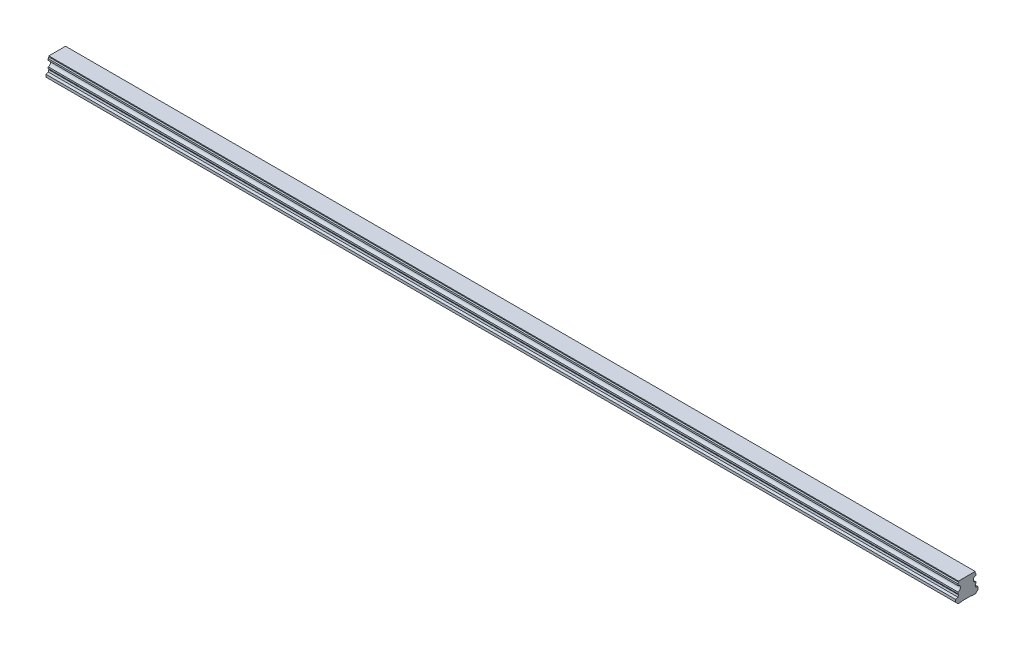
ISO-10303-21;
HEADER;
FILE_DESCRIPTION(('STEP AP214'),'2;1');
FILE_NAME('part.step','',(''),(''),'','','');
FILE_SCHEMA(('AUTOMOTIVE_DESIGN { 1 0 10303 214 1 1 1 1 }'));
ENDSEC;
DATA;
#1=APPLICATION_CONTEXT('core data for automotive mechanical design processes');
#2=APPLICATION_PROTOCOL_DEFINITION('international standard','automotive_design',2000,#1);
#3=PRODUCT_CONTEXT('',#1,'mechanical');
#4=PRODUCT('Part','Part','',(#3));
#5=PRODUCT_RELATED_PRODUCT_CATEGORY('part','',(#4));
#6=PRODUCT_DEFINITION_FORMATION('','',#4);
#7=PRODUCT_DEFINITION_CONTEXT('part definition',#1,'design');
#8=PRODUCT_DEFINITION('design','',#6,#7);
#9=PRODUCT_DEFINITION_SHAPE('','',#8);
#10=(LENGTH_UNIT() NAMED_UNIT(*) SI_UNIT(.MILLI.,.METRE.));
#11=(NAMED_UNIT(*) PLANE_ANGLE_UNIT() SI_UNIT($,.RADIAN.));
#12=(NAMED_UNIT(*) SI_UNIT($,.STERADIAN.) SOLID_ANGLE_UNIT());
#13=UNCERTAINTY_MEASURE_WITH_UNIT(LENGTH_MEASURE(1.E-05),#10,'distance_accuracy_value','');
#14=(GEOMETRIC_REPRESENTATION_CONTEXT(3) GLOBAL_UNCERTAINTY_ASSIGNED_CONTEXT((#13)) GLOBAL_UNIT_ASSIGNED_CONTEXT((#10,
#11,#12)) REPRESENTATION_CONTEXT('',''));
#15=CARTESIAN_POINT('',(0.,0.,0.));
#16=DIRECTION('',(0.,0.,1.));
#17=DIRECTION('',(1.,0.,0.));
#18=AXIS2_PLACEMENT_3D('',#15,#16,#17);
#19=CARTESIAN_POINT('',(990.,0.499999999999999,0.));
#20=DIRECTION('',(0.,-1.,0.));
#21=DIRECTION('',(0.,0.,-1.));
#22=AXIS2_PLACEMENT_3D('',#19,#20,#21);
#23=CONICAL_SURFACE('',#22,3.5,0.785398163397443);
#24=CARTESIAN_POINT('',(990.,1.00000000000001,0.));
#25=DIRECTION('',(0.,1.,0.));
#26=DIRECTION('',(0.,0.,1.));
#27=AXIS2_PLACEMENT_3D('',#24,#25,#26);
#28=CIRCLE('',#27,3.);
#29=CARTESIAN_POINT('',(990.,1.00000000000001,3.));
#30=VERTEX_POINT('',#29);
#31=EDGE_CURVE('E11',#30,#30,#28,.F.);
#32=ORIENTED_EDGE('',*,*,#31,.F.);
#33=EDGE_LOOP('',(#32));
#34=FACE_BOUND('',#33,.T.);
#35=CARTESIAN_POINT('',(990.,0.499999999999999,0.));
#36=DIRECTION('',(0.,1.,0.));
#37=DIRECTION('',(0.,0.,1.));
#38=AXIS2_PLACEMENT_3D('',#35,#36,#37);
#39=CIRCLE('',#38,3.5);
#40=CARTESIAN_POINT('',(990.,0.5,3.5));
#41=VERTEX_POINT('',#40);
#42=EDGE_CURVE('E602',#41,#41,#39,.T.);
#43=ORIENTED_EDGE('',*,*,#42,.F.);
#44=EDGE_LOOP('',(#43));
#45=FACE_BOUND('',#44,.T.);
#46=ADVANCED_FACE('F39',(#34,#45),#23,.F.);
#47=CARTESIAN_POINT('',(990.,12.,0.));
#48=DIRECTION('',(0.,-1.,0.));
#49=DIRECTION('',(0.,0.,-1.));
#50=AXIS2_PLACEMENT_3D('',#47,#48,#49);
#51=CYLINDRICAL_SURFACE('',#50,3.);
#52=ORIENTED_EDGE('',*,*,#31,.T.);
#53=EDGE_LOOP('',(#52));
#54=FACE_BOUND('',#53,.T.);
#55=CARTESIAN_POINT('',(990.,12.,0.));
#56=DIRECTION('',(0.,-1.,0.));
#57=DIRECTION('',(0.,0.,-1.));
#58=AXIS2_PLACEMENT_3D('',#55,#56,#57);
#59=CIRCLE('',#58,3.);
#60=CARTESIAN_POINT('',(990.,12.,-3.));
#61=VERTEX_POINT('',#60);
#62=EDGE_CURVE('E49',#61,#61,#59,.T.);
#63=ORIENTED_EDGE('',*,*,#62,.F.);
#64=EDGE_LOOP('',(#63));
#65=FACE_BOUND('',#64,.T.);
#66=ADVANCED_FACE('F831',(#54,#65),#51,.F.);
#67=CARTESIAN_POINT('',(990.,12.,0.));
#68=DIRECTION('',(0.,-1.,0.));
#69=DIRECTION('',(0.,0.,-1.));
#70=AXIS2_PLACEMENT_3D('',#67,#68,#69);
#71=PLANE('',#70);
#72=CARTESIAN_POINT('',(990.,12.,0.));
#73=DIRECTION('',(0.,-1.,0.));
#74=DIRECTION('',(0.,0.,-1.));
#75=AXIS2_PLACEMENT_3D('',#72,#73,#74);
#76=CIRCLE('',#75,2.5);
#77=CARTESIAN_POINT('',(990.,12.,-2.5));
#78=VERTEX_POINT('',#77);
#79=EDGE_CURVE('E42',#78,#78,#76,.T.);
#80=ORIENTED_EDGE('',*,*,#79,.F.);
#81=EDGE_LOOP('',(#80));
#82=FACE_BOUND('',#81,.T.);
#83=ORIENTED_EDGE('',*,*,#62,.T.);
#84=EDGE_LOOP('',(#83));
#85=FACE_BOUND('',#84,.T.);
#86=ADVANCED_FACE('F836',(#82,#85),#71,.T.);
#87=CARTESIAN_POINT('',(930.,0.499999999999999,0.));
#88=DIRECTION('',(0.,-1.,0.));
#89=DIRECTION('',(0.,0.,-1.));
#90=AXIS2_PLACEMENT_3D('',#87,#88,#89);
#91=CONICAL_SURFACE('',#90,3.5,0.785398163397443);
#92=CARTESIAN_POINT('',(930.,1.00000000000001,0.));
#93=DIRECTION('',(0.,1.,0.));
#94=DIRECTION('',(0.,0.,1.));
#95=AXIS2_PLACEMENT_3D('',#92,#93,#94);
#96=CIRCLE('',#95,3.);
#97=CARTESIAN_POINT('',(930.,1.00000000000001,3.));
#98=VERTEX_POINT('',#97);
#99=EDGE_CURVE('E598',#98,#98,#96,.F.);
#100=ORIENTED_EDGE('',*,*,#99,.F.);
#101=EDGE_LOOP('',(#100));
#102=FACE_BOUND('',#101,.T.);
#103=CARTESIAN_POINT('',(930.,0.499999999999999,0.));
#104=DIRECTION('',(0.,1.,0.));
#105=DIRECTION('',(0.,0.,1.));
#106=AXIS2_PLACEMENT_3D('',#103,#104,#105);
#107=CIRCLE('',#106,3.5);
#108=CARTESIAN_POINT('',(930.,0.5,3.5));
#109=VERTEX_POINT('',#108);
#110=EDGE_CURVE('E590',#109,#109,#107,.T.);
#111=ORIENTED_EDGE('',*,*,#110,.F.);
#112=EDGE_LOOP('',(#111));
#113=FACE_BOUND('',#112,.T.);
#114=ADVANCED_FACE('F1079',(#102,#113),#91,.F.);
#115=CARTESIAN_POINT('',(930.,12.,0.));
#116=DIRECTION('',(0.,-1.,0.));
#117=DIRECTION('',(0.,0.,-1.));
#118=AXIS2_PLACEMENT_3D('',#115,#116,#117);
#119=CYLINDRICAL_SURFACE('',#118,3.);
#120=ORIENTED_EDGE('',*,*,#99,.T.);
#121=EDGE_LOOP('',(#120));
#122=FACE_BOUND('',#121,.T.);
#123=CARTESIAN_POINT('',(930.,12.,0.));
#124=DIRECTION('',(0.,-1.,0.));
#125=DIRECTION('',(0.,0.,-1.));
#126=AXIS2_PLACEMENT_3D('',#123,#124,#125);
#127=CIRCLE('',#126,3.);
#128=CARTESIAN_POINT('',(930.,12.,-3.));
#129=VERTEX_POINT('',#128);
#130=EDGE_CURVE('E594',#129,#129,#127,.T.);
#131=ORIENTED_EDGE('',*,*,#130,.F.);
#132=EDGE_LOOP('',(#131));
#133=FACE_BOUND('',#132,.T.);
#134=ADVANCED_FACE('F1075',(#122,#133),#119,.F.);
#135=CARTESIAN_POINT('',(930.,12.,0.));
#136=DIRECTION('',(0.,-1.,0.));
#137=DIRECTION('',(0.,0.,-1.));
#138=AXIS2_PLACEMENT_3D('',#135,#136,#137);
#139=PLANE('',#138);
#140=CARTESIAN_POINT('',(930.,12.,0.));
#141=DIRECTION('',(0.,-1.,0.));
#142=DIRECTION('',(0.,0.,-1.));
#143=AXIS2_PLACEMENT_3D('',#140,#141,#142);
#144=CIRCLE('',#143,2.5);
#145=CARTESIAN_POINT('',(930.,12.,-2.5));
#146=VERTEX_POINT('',#145);
#147=EDGE_CURVE('E665',#146,#146,#144,.T.);
#148=ORIENTED_EDGE('',*,*,#147,.F.);
#149=EDGE_LOOP('',(#148));
#150=FACE_BOUND('',#149,.T.);
#151=ORIENTED_EDGE('',*,*,#130,.T.);
#152=EDGE_LOOP('',(#151));
#153=FACE_BOUND('',#152,.T.);
#154=ADVANCED_FACE('F1071',(#150,#153),#139,.T.);
#155=CARTESIAN_POINT('',(870.,0.499999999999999,0.));
#156=DIRECTION('',(0.,-1.,0.));
#157=DIRECTION('',(0.,0.,-1.));
#158=AXIS2_PLACEMENT_3D('',#155,#156,#157);
#159=CONICAL_SURFACE('',#158,3.5,0.785398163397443);
#160=CARTESIAN_POINT('',(870.,1.00000000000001,0.));
#161=DIRECTION('',(0.,1.,0.));
#162=DIRECTION('',(0.,0.,1.));
#163=AXIS2_PLACEMENT_3D('',#160,#161,#162);
#164=CIRCLE('',#163,3.);
#165=CARTESIAN_POINT('',(870.,1.00000000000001,3.));
#166=VERTEX_POINT('',#165);
#167=EDGE_CURVE('E586',#166,#166,#164,.F.);
#168=ORIENTED_EDGE('',*,*,#167,.F.);
#169=EDGE_LOOP('',(#168));
#170=FACE_BOUND('',#169,.T.);
#171=CARTESIAN_POINT('',(870.,0.499999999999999,0.));
#172=DIRECTION('',(0.,1.,0.));
#173=DIRECTION('',(0.,0.,1.));
#174=AXIS2_PLACEMENT_3D('',#171,#172,#173);
#175=CIRCLE('',#174,3.5);
#176=CARTESIAN_POINT('',(870.,0.5,3.5));
#177=VERTEX_POINT('',#176);
#178=EDGE_CURVE('E578',#177,#177,#175,.T.);
#179=ORIENTED_EDGE('',*,*,#178,.F.);
#180=EDGE_LOOP('',(#179));
#181=FACE_BOUND('',#180,.T.);
#182=ADVANCED_FACE('F1067',(#170,#181),#159,.F.);
#183=CARTESIAN_POINT('',(870.,12.,0.));
#184=DIRECTION('',(0.,-1.,0.));
#185=DIRECTION('',(0.,0.,-1.));
#186=AXIS2_PLACEMENT_3D('',#183,#184,#185);
#187=CYLINDRICAL_SURFACE('',#186,3.);
#188=ORIENTED_EDGE('',*,*,#167,.T.);
#189=EDGE_LOOP('',(#188));
#190=FACE_BOUND('',#189,.T.);
#191=CARTESIAN_POINT('',(870.,12.,0.));
#192=DIRECTION('',(0.,-1.,0.));
#193=DIRECTION('',(0.,0.,-1.));
#194=AXIS2_PLACEMENT_3D('',#191,#192,#193);
#195=CIRCLE('',#194,3.);
#196=CARTESIAN_POINT('',(870.,12.,-3.));
#197=VERTEX_POINT('',#196);
#198=EDGE_CURVE('E582',#197,#197,#195,.T.);
#199=ORIENTED_EDGE('',*,*,#198,.F.);
#200=EDGE_LOOP('',(#199));
#201=FACE_BOUND('',#200,.T.);
#202=ADVANCED_FACE('F1063',(#190,#201),#187,.F.);
#203=CARTESIAN_POINT('',(870.,12.,0.));
#204=DIRECTION('',(0.,-1.,0.));
#205=DIRECTION('',(0.,0.,-1.));
#206=AXIS2_PLACEMENT_3D('',#203,#204,#205);
#207=PLANE('',#206);
#208=CARTESIAN_POINT('',(870.,12.,0.));
#209=DIRECTION('',(0.,-1.,0.));
#210=DIRECTION('',(0.,0.,-1.));
#211=AXIS2_PLACEMENT_3D('',#208,#209,#210);
#212=CIRCLE('',#211,2.5);
#213=CARTESIAN_POINT('',(870.,12.,-2.5));
#214=VERTEX_POINT('',#213);
#215=EDGE_CURVE('E662',#214,#214,#212,.T.);
#216=ORIENTED_EDGE('',*,*,#215,.F.);
#217=EDGE_LOOP('',(#216));
#218=FACE_BOUND('',#217,.T.);
#219=ORIENTED_EDGE('',*,*,#198,.T.);
#220=EDGE_LOOP('',(#219));
#221=FACE_BOUND('',#220,.T.);
#222=ADVANCED_FACE('F1059',(#218,#221),#207,.T.);
#223=CARTESIAN_POINT('',(810.,0.499999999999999,0.));
#224=DIRECTION('',(0.,-1.,0.));
#225=DIRECTION('',(0.,0.,-1.));
#226=AXIS2_PLACEMENT_3D('',#223,#224,#225);
#227=CONICAL_SURFACE('',#226,3.5,0.785398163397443);
#228=CARTESIAN_POINT('',(810.,1.00000000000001,0.));
#229=DIRECTION('',(0.,1.,0.));
#230=DIRECTION('',(0.,0.,1.));
#231=AXIS2_PLACEMENT_3D('',#228,#229,#230);
#232=CIRCLE('',#231,3.);
#233=CARTESIAN_POINT('',(810.,1.00000000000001,3.));
#234=VERTEX_POINT('',#233);
#235=EDGE_CURVE('E574',#234,#234,#232,.F.);
#236=ORIENTED_EDGE('',*,*,#235,.F.);
#237=EDGE_LOOP('',(#236));
#238=FACE_BOUND('',#237,.T.);
#239=CARTESIAN_POINT('',(810.,0.499999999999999,0.));
#240=DIRECTION('',(0.,1.,0.));
#241=DIRECTION('',(0.,0.,1.));
#242=AXIS2_PLACEMENT_3D('',#239,#240,#241);
#243=CIRCLE('',#242,3.5);
#244=CARTESIAN_POINT('',(810.,0.5,3.5));
#245=VERTEX_POINT('',#244);
#246=EDGE_CURVE('E566',#245,#245,#243,.T.);
#247=ORIENTED_EDGE('',*,*,#246,.F.);
#248=EDGE_LOOP('',(#247));
#249=FACE_BOUND('',#248,.T.);
#250=ADVANCED_FACE('F1055',(#238,#249),#227,.F.);
#251=CARTESIAN_POINT('',(810.,12.,0.));
#252=DIRECTION('',(0.,-1.,0.));
#253=DIRECTION('',(0.,0.,-1.));
#254=AXIS2_PLACEMENT_3D('',#251,#252,#253);
#255=CYLINDRICAL_SURFACE('',#254,3.);
#256=ORIENTED_EDGE('',*,*,#235,.T.);
#257=EDGE_LOOP('',(#256));
#258=FACE_BOUND('',#257,.T.);
#259=CARTESIAN_POINT('',(810.,12.,0.));
#260=DIRECTION('',(0.,-1.,0.));
#261=DIRECTION('',(0.,0.,-1.));
#262=AXIS2_PLACEMENT_3D('',#259,#260,#261);
#263=CIRCLE('',#262,3.);
#264=CARTESIAN_POINT('',(810.,12.,-3.));
#265=VERTEX_POINT('',#264);
#266=EDGE_CURVE('E570',#265,#265,#263,.T.);
#267=ORIENTED_EDGE('',*,*,#266,.F.);
#268=EDGE_LOOP('',(#267));
#269=FACE_BOUND('',#268,.T.);
#270=ADVANCED_FACE('F1051',(#258,#269),#255,.F.);
#271=CARTESIAN_POINT('',(810.,12.,0.));
#272=DIRECTION('',(0.,-1.,0.));
#273=DIRECTION('',(0.,0.,-1.));
#274=AXIS2_PLACEMENT_3D('',#271,#272,#273);
#275=PLANE('',#274);
#276=CARTESIAN_POINT('',(810.,12.,0.));
#277=DIRECTION('',(0.,-1.,0.));
#278=DIRECTION('',(0.,0.,-1.));
#279=AXIS2_PLACEMENT_3D('',#276,#277,#278);
#280=CIRCLE('',#279,2.5);
#281=CARTESIAN_POINT('',(810.,12.,-2.5));
#282=VERTEX_POINT('',#281);
#283=EDGE_CURVE('E658',#282,#282,#280,.T.);
#284=ORIENTED_EDGE('',*,*,#283,.F.);
#285=EDGE_LOOP('',(#284));
#286=FACE_BOUND('',#285,.T.);
#287=ORIENTED_EDGE('',*,*,#266,.T.);
#288=EDGE_LOOP('',(#287));
#289=FACE_BOUND('',#288,.T.);
#290=ADVANCED_FACE('F1047',(#286,#289),#275,.T.);
#291=CARTESIAN_POINT('',(750.,0.499999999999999,0.));
#292=DIRECTION('',(0.,-1.,0.));
#293=DIRECTION('',(0.,0.,-1.));
#294=AXIS2_PLACEMENT_3D('',#291,#292,#293);
#295=CONICAL_SURFACE('',#294,3.5,0.785398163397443);
#296=CARTESIAN_POINT('',(750.,1.00000000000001,0.));
#297=DIRECTION('',(0.,1.,0.));
#298=DIRECTION('',(0.,0.,1.));
#299=AXIS2_PLACEMENT_3D('',#296,#297,#298);
#300=CIRCLE('',#299,3.);
#301=CARTESIAN_POINT('',(750.,1.00000000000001,3.));
#302=VERTEX_POINT('',#301);
#303=EDGE_CURVE('E562',#302,#302,#300,.F.);
#304=ORIENTED_EDGE('',*,*,#303,.F.);
#305=EDGE_LOOP('',(#304));
#306=FACE_BOUND('',#305,.T.);
#307=CARTESIAN_POINT('',(750.,0.499999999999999,0.));
#308=DIRECTION('',(0.,1.,0.));
#309=DIRECTION('',(0.,0.,1.));
#310=AXIS2_PLACEMENT_3D('',#307,#308,#309);
#311=CIRCLE('',#310,3.5);
#312=CARTESIAN_POINT('',(750.,0.5,3.5));
#313=VERTEX_POINT('',#312);
#314=EDGE_CURVE('E554',#313,#313,#311,.T.);
#315=ORIENTED_EDGE('',*,*,#314,.F.);
#316=EDGE_LOOP('',(#315));
#317=FACE_BOUND('',#316,.T.);
#318=ADVANCED_FACE('F1043',(#306,#317),#295,.F.);
#319=CARTESIAN_POINT('',(750.,12.,0.));
#320=DIRECTION('',(0.,-1.,0.));
#321=DIRECTION('',(0.,0.,-1.));
#322=AXIS2_PLACEMENT_3D('',#319,#320,#321);
#323=CYLINDRICAL_SURFACE('',#322,3.);
#324=ORIENTED_EDGE('',*,*,#303,.T.);
#325=EDGE_LOOP('',(#324));
#326=FACE_BOUND('',#325,.T.);
#327=CARTESIAN_POINT('',(750.,12.,0.));
#328=DIRECTION('',(0.,-1.,0.));
#329=DIRECTION('',(0.,0.,-1.));
#330=AXIS2_PLACEMENT_3D('',#327,#328,#329);
#331=CIRCLE('',#330,3.);
#332=CARTESIAN_POINT('',(750.,12.,-3.));
#333=VERTEX_POINT('',#332);
#334=EDGE_CURVE('E558',#333,#333,#331,.T.);
#335=ORIENTED_EDGE('',*,*,#334,.F.);
#336=EDGE_LOOP('',(#335));
#337=FACE_BOUND('',#336,.T.);
#338=ADVANCED_FACE('F1039',(#326,#337),#323,.F.);
#339=CARTESIAN_POINT('',(750.,12.,0.));
#340=DIRECTION('',(0.,-1.,0.));
#341=DIRECTION('',(0.,0.,-1.));
#342=AXIS2_PLACEMENT_3D('',#339,#340,#341);
#343=PLANE('',#342);
#344=CARTESIAN_POINT('',(750.,12.,0.));
#345=DIRECTION('',(0.,-1.,0.));
#346=DIRECTION('',(0.,0.,-1.));
#347=AXIS2_PLACEMENT_3D('',#344,#345,#346);
#348=CIRCLE('',#347,2.5);
#349=CARTESIAN_POINT('',(750.,12.,-2.5));
#350=VERTEX_POINT('',#349);
#351=EDGE_CURVE('E654',#350,#350,#348,.T.);
#352=ORIENTED_EDGE('',*,*,#351,.F.);
#353=EDGE_LOOP('',(#352));
#354=FACE_BOUND('',#353,.T.);
#355=ORIENTED_EDGE('',*,*,#334,.T.);
#356=EDGE_LOOP('',(#355));
#357=FACE_BOUND('',#356,.T.);
#358=ADVANCED_FACE('F1035',(#354,#357),#343,.T.);
#359=CARTESIAN_POINT('',(690.,0.499999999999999,0.));
#360=DIRECTION('',(0.,-1.,0.));
#361=DIRECTION('',(0.,0.,-1.));
#362=AXIS2_PLACEMENT_3D('',#359,#360,#361);
#363=CONICAL_SURFACE('',#362,3.5,0.785398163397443);
#364=CARTESIAN_POINT('',(690.,1.00000000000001,0.));
#365=DIRECTION('',(0.,1.,0.));
#366=DIRECTION('',(0.,0.,1.));
#367=AXIS2_PLACEMENT_3D('',#364,#365,#366);
#368=CIRCLE('',#367,3.);
#369=CARTESIAN_POINT('',(690.,1.00000000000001,3.));
#370=VERTEX_POINT('',#369);
#371=EDGE_CURVE('E550',#370,#370,#368,.F.);
#372=ORIENTED_EDGE('',*,*,#371,.F.);
#373=EDGE_LOOP('',(#372));
#374=FACE_BOUND('',#373,.T.);
#375=CARTESIAN_POINT('',(690.,0.499999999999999,0.));
#376=DIRECTION('',(0.,1.,0.));
#377=DIRECTION('',(0.,0.,1.));
#378=AXIS2_PLACEMENT_3D('',#375,#376,#377);
#379=CIRCLE('',#378,3.5);
#380=CARTESIAN_POINT('',(690.,0.5,3.5));
#381=VERTEX_POINT('',#380);
#382=EDGE_CURVE('E542',#381,#381,#379,.T.);
#383=ORIENTED_EDGE('',*,*,#382,.F.);
#384=EDGE_LOOP('',(#383));
#385=FACE_BOUND('',#384,.T.);
#386=ADVANCED_FACE('F1031',(#374,#385),#363,.F.);
#387=CARTESIAN_POINT('',(690.,12.,0.));
#388=DIRECTION('',(0.,-1.,0.));
#389=DIRECTION('',(0.,0.,-1.));
#390=AXIS2_PLACEMENT_3D('',#387,#388,#389);
#391=CYLINDRICAL_SURFACE('',#390,3.);
#392=ORIENTED_EDGE('',*,*,#371,.T.);
#393=EDGE_LOOP('',(#392));
#394=FACE_BOUND('',#393,.T.);
#395=CARTESIAN_POINT('',(690.,12.,0.));
#396=DIRECTION('',(0.,-1.,0.));
#397=DIRECTION('',(0.,0.,-1.));
#398=AXIS2_PLACEMENT_3D('',#395,#396,#397);
#399=CIRCLE('',#398,3.);
#400=CARTESIAN_POINT('',(690.,12.,-3.));
#401=VERTEX_POINT('',#400);
#402=EDGE_CURVE('E546',#401,#401,#399,.T.);
#403=ORIENTED_EDGE('',*,*,#402,.F.);
#404=EDGE_LOOP('',(#403));
#405=FACE_BOUND('',#404,.T.);
#406=ADVANCED_FACE('F1027',(#394,#405),#391,.F.);
#407=CARTESIAN_POINT('',(690.,12.,0.));
#408=DIRECTION('',(0.,-1.,0.));
#409=DIRECTION('',(0.,0.,-1.));
#410=AXIS2_PLACEMENT_3D('',#407,#408,#409);
#411=PLANE('',#410);
#412=CARTESIAN_POINT('',(690.,12.,0.));
#413=DIRECTION('',(0.,-1.,0.));
#414=DIRECTION('',(0.,0.,-1.));
#415=AXIS2_PLACEMENT_3D('',#412,#413,#414);
#416=CIRCLE('',#415,2.5);
#417=CARTESIAN_POINT('',(690.,12.,-2.5));
#418=VERTEX_POINT('',#417);
#419=EDGE_CURVE('E650',#418,#418,#416,.T.);
#420=ORIENTED_EDGE('',*,*,#419,.F.);
#421=EDGE_LOOP('',(#420));
#422=FACE_BOUND('',#421,.T.);
#423=ORIENTED_EDGE('',*,*,#402,.T.);
#424=EDGE_LOOP('',(#423));
#425=FACE_BOUND('',#424,.T.);
#426=ADVANCED_FACE('F1023',(#422,#425),#411,.T.);
#427=CARTESIAN_POINT('',(630.,0.499999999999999,0.));
#428=DIRECTION('',(0.,-1.,0.));
#429=DIRECTION('',(0.,0.,-1.));
#430=AXIS2_PLACEMENT_3D('',#427,#428,#429);
#431=CONICAL_SURFACE('',#430,3.5,0.785398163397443);
#432=CARTESIAN_POINT('',(630.,1.00000000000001,0.));
#433=DIRECTION('',(0.,1.,0.));
#434=DIRECTION('',(0.,0.,1.));
#435=AXIS2_PLACEMENT_3D('',#432,#433,#434);
#436=CIRCLE('',#435,3.);
#437=CARTESIAN_POINT('',(630.,1.00000000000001,3.));
#438=VERTEX_POINT('',#437);
#439=EDGE_CURVE('E538',#438,#438,#436,.F.);
#440=ORIENTED_EDGE('',*,*,#439,.F.);
#441=EDGE_LOOP('',(#440));
#442=FACE_BOUND('',#441,.T.);
#443=CARTESIAN_POINT('',(630.,0.499999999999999,0.));
#444=DIRECTION('',(0.,1.,0.));
#445=DIRECTION('',(0.,0.,1.));
#446=AXIS2_PLACEMENT_3D('',#443,#444,#445);
#447=CIRCLE('',#446,3.5);
#448=CARTESIAN_POINT('',(630.,0.5,3.5));
#449=VERTEX_POINT('',#448);
#450=EDGE_CURVE('E530',#449,#449,#447,.T.);
#451=ORIENTED_EDGE('',*,*,#450,.F.);
#452=EDGE_LOOP('',(#451));
#453=FACE_BOUND('',#452,.T.);
#454=ADVANCED_FACE('F1019',(#442,#453),#431,.F.);
#455=CARTESIAN_POINT('',(630.,12.,0.));
#456=DIRECTION('',(0.,-1.,0.));
#457=DIRECTION('',(0.,0.,-1.));
#458=AXIS2_PLACEMENT_3D('',#455,#456,#457);
#459=CYLINDRICAL_SURFACE('',#458,3.);
#460=ORIENTED_EDGE('',*,*,#439,.T.);
#461=EDGE_LOOP('',(#460));
#462=FACE_BOUND('',#461,.T.);
#463=CARTESIAN_POINT('',(630.,12.,0.));
#464=DIRECTION('',(0.,-1.,0.));
#465=DIRECTION('',(0.,0.,-1.));
#466=AXIS2_PLACEMENT_3D('',#463,#464,#465);
#467=CIRCLE('',#466,3.);
#468=CARTESIAN_POINT('',(630.,12.,-3.));
#469=VERTEX_POINT('',#468);
#470=EDGE_CURVE('E534',#469,#469,#467,.T.);
#471=ORIENTED_EDGE('',*,*,#470,.F.);
#472=EDGE_LOOP('',(#471));
#473=FACE_BOUND('',#472,.T.);
#474=ADVANCED_FACE('F1015',(#462,#473),#459,.F.);
#475=CARTESIAN_POINT('',(630.,12.,0.));
#476=DIRECTION('',(0.,-1.,0.));
#477=DIRECTION('',(0.,0.,-1.));
#478=AXIS2_PLACEMENT_3D('',#475,#476,#477);
#479=PLANE('',#478);
#480=CARTESIAN_POINT('',(630.,12.,0.));
#481=DIRECTION('',(0.,-1.,0.));
#482=DIRECTION('',(0.,0.,-1.));
#483=AXIS2_PLACEMENT_3D('',#480,#481,#482);
#484=CIRCLE('',#483,2.5);
#485=CARTESIAN_POINT('',(630.,12.,-2.5));
#486=VERTEX_POINT('',#485);
#487=EDGE_CURVE('E646',#486,#486,#484,.T.);
#488=ORIENTED_EDGE('',*,*,#487,.F.);
#489=EDGE_LOOP('',(#488));
#490=FACE_BOUND('',#489,.T.);
#491=ORIENTED_EDGE('',*,*,#470,.T.);
#492=EDGE_LOOP('',(#491));
#493=FACE_BOUND('',#492,.T.);
#494=ADVANCED_FACE('F1011',(#490,#493),#479,.T.);
#495=CARTESIAN_POINT('',(570.,0.499999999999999,0.));
#496=DIRECTION('',(0.,-1.,0.));
#497=DIRECTION('',(0.,0.,-1.));
#498=AXIS2_PLACEMENT_3D('',#495,#496,#497);
#499=CONICAL_SURFACE('',#498,3.5,0.785398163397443);
#500=CARTESIAN_POINT('',(570.,1.00000000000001,0.));
#501=DIRECTION('',(0.,1.,0.));
#502=DIRECTION('',(0.,0.,1.));
#503=AXIS2_PLACEMENT_3D('',#500,#501,#502);
#504=CIRCLE('',#503,3.);
#505=CARTESIAN_POINT('',(570.,1.00000000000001,3.));
#506=VERTEX_POINT('',#505);
#507=EDGE_CURVE('E526',#506,#506,#504,.F.);
#508=ORIENTED_EDGE('',*,*,#507,.F.);
#509=EDGE_LOOP('',(#508));
#510=FACE_BOUND('',#509,.T.);
#511=CARTESIAN_POINT('',(570.,0.499999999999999,0.));
#512=DIRECTION('',(0.,1.,0.));
#513=DIRECTION('',(0.,0.,1.));
#514=AXIS2_PLACEMENT_3D('',#511,#512,#513);
#515=CIRCLE('',#514,3.5);
#516=CARTESIAN_POINT('',(570.,0.5,3.5));
#517=VERTEX_POINT('',#516);
#518=EDGE_CURVE('E518',#517,#517,#515,.T.);
#519=ORIENTED_EDGE('',*,*,#518,.F.);
#520=EDGE_LOOP('',(#519));
#521=FACE_BOUND('',#520,.T.);
#522=ADVANCED_FACE('F1007',(#510,#521),#499,.F.);
#523=CARTESIAN_POINT('',(570.,12.,0.));
#524=DIRECTION('',(0.,-1.,0.));
#525=DIRECTION('',(0.,0.,-1.));
#526=AXIS2_PLACEMENT_3D('',#523,#524,#525);
#527=CYLINDRICAL_SURFACE('',#526,3.);
#528=ORIENTED_EDGE('',*,*,#507,.T.);
#529=EDGE_LOOP('',(#528));
#530=FACE_BOUND('',#529,.T.);
#531=CARTESIAN_POINT('',(570.,12.,0.));
#532=DIRECTION('',(0.,-1.,0.));
#533=DIRECTION('',(0.,0.,-1.));
#534=AXIS2_PLACEMENT_3D('',#531,#532,#533);
#535=CIRCLE('',#534,3.);
#536=CARTESIAN_POINT('',(570.,12.,-3.));
#537=VERTEX_POINT('',#536);
#538=EDGE_CURVE('E522',#537,#537,#535,.T.);
#539=ORIENTED_EDGE('',*,*,#538,.F.);
#540=EDGE_LOOP('',(#539));
#541=FACE_BOUND('',#540,.T.);
#542=ADVANCED_FACE('F1003',(#530,#541),#527,.F.);
#543=CARTESIAN_POINT('',(570.,12.,0.));
#544=DIRECTION('',(0.,-1.,0.));
#545=DIRECTION('',(0.,0.,-1.));
#546=AXIS2_PLACEMENT_3D('',#543,#544,#545);
#547=PLANE('',#546);
#548=CARTESIAN_POINT('',(570.,12.,0.));
#549=DIRECTION('',(0.,-1.,0.));
#550=DIRECTION('',(0.,0.,-1.));
#551=AXIS2_PLACEMENT_3D('',#548,#549,#550);
#552=CIRCLE('',#551,2.5);
#553=CARTESIAN_POINT('',(570.,12.,-2.5));
#554=VERTEX_POINT('',#553);
#555=EDGE_CURVE('E642',#554,#554,#552,.T.);
#556=ORIENTED_EDGE('',*,*,#555,.F.);
#557=EDGE_LOOP('',(#556));
#558=FACE_BOUND('',#557,.T.);
#559=ORIENTED_EDGE('',*,*,#538,.T.);
#560=EDGE_LOOP('',(#559));
#561=FACE_BOUND('',#560,.T.);
#562=ADVANCED_FACE('F999',(#558,#561),#547,.T.);
#563=CARTESIAN_POINT('',(510.,0.499999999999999,0.));
#564=DIRECTION('',(0.,-1.,0.));
#565=DIRECTION('',(0.,0.,-1.));
#566=AXIS2_PLACEMENT_3D('',#563,#564,#565);
#567=CONICAL_SURFACE('',#566,3.5,0.785398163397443);
#568=CARTESIAN_POINT('',(510.,1.00000000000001,0.));
#569=DIRECTION('',(0.,1.,0.));
#570=DIRECTION('',(0.,0.,1.));
#571=AXIS2_PLACEMENT_3D('',#568,#569,#570);
#572=CIRCLE('',#571,3.);
#573=CARTESIAN_POINT('',(510.,1.00000000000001,3.));
#574=VERTEX_POINT('',#573);
#575=EDGE_CURVE('E514',#574,#574,#572,.F.);
#576=ORIENTED_EDGE('',*,*,#575,.F.);
#577=EDGE_LOOP('',(#576));
#578=FACE_BOUND('',#577,.T.);
#579=CARTESIAN_POINT('',(510.,0.499999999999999,0.));
#580=DIRECTION('',(0.,1.,0.));
#581=DIRECTION('',(0.,0.,1.));
#582=AXIS2_PLACEMENT_3D('',#579,#580,#581);
#583=CIRCLE('',#582,3.5);
#584=CARTESIAN_POINT('',(510.,0.5,3.5));
#585=VERTEX_POINT('',#584);
#586=EDGE_CURVE('E506',#585,#585,#583,.T.);
#587=ORIENTED_EDGE('',*,*,#586,.F.);
#588=EDGE_LOOP('',(#587));
#589=FACE_BOUND('',#588,.T.);
#590=ADVANCED_FACE('F995',(#578,#589),#567,.F.);
#591=CARTESIAN_POINT('',(510.,12.,0.));
#592=DIRECTION('',(0.,-1.,0.));
#593=DIRECTION('',(0.,0.,-1.));
#594=AXIS2_PLACEMENT_3D('',#591,#592,#593);
#595=CYLINDRICAL_SURFACE('',#594,3.);
#596=ORIENTED_EDGE('',*,*,#575,.T.);
#597=EDGE_LOOP('',(#596));
#598=FACE_BOUND('',#597,.T.);
#599=CARTESIAN_POINT('',(510.,12.,0.));
#600=DIRECTION('',(0.,-1.,0.));
#601=DIRECTION('',(0.,0.,-1.));
#602=AXIS2_PLACEMENT_3D('',#599,#600,#601);
#603=CIRCLE('',#602,3.);
#604=CARTESIAN_POINT('',(510.,12.,-3.));
#605=VERTEX_POINT('',#604);
#606=EDGE_CURVE('E510',#605,#605,#603,.T.);
#607=ORIENTED_EDGE('',*,*,#606,.F.);
#608=EDGE_LOOP('',(#607));
#609=FACE_BOUND('',#608,.T.);
#610=ADVANCED_FACE('F991',(#598,#609),#595,.F.);
#611=CARTESIAN_POINT('',(510.,12.,0.));
#612=DIRECTION('',(0.,-1.,0.));
#613=DIRECTION('',(0.,0.,-1.));
#614=AXIS2_PLACEMENT_3D('',#611,#612,#613);
#615=PLANE('',#614);
#616=CARTESIAN_POINT('',(510.,12.,0.));
#617=DIRECTION('',(0.,-1.,0.));
#618=DIRECTION('',(0.,0.,-1.));
#619=AXIS2_PLACEMENT_3D('',#616,#617,#618);
#620=CIRCLE('',#619,2.5);
#621=CARTESIAN_POINT('',(510.,12.,-2.5));
#622=VERTEX_POINT('',#621);
#623=EDGE_CURVE('E638',#622,#622,#620,.T.);
#624=ORIENTED_EDGE('',*,*,#623,.F.);
#625=EDGE_LOOP('',(#624));
#626=FACE_BOUND('',#625,.T.);
#627=ORIENTED_EDGE('',*,*,#606,.T.);
#628=EDGE_LOOP('',(#627));
#629=FACE_BOUND('',#628,.T.);
#630=ADVANCED_FACE('F987',(#626,#629),#615,.T.);
#631=CARTESIAN_POINT('',(450.,0.499999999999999,0.));
#632=DIRECTION('',(0.,-1.,0.));
#633=DIRECTION('',(0.,0.,-1.));
#634=AXIS2_PLACEMENT_3D('',#631,#632,#633);
#635=CONICAL_SURFACE('',#634,3.5,0.785398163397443);
#636=CARTESIAN_POINT('',(450.,1.00000000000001,0.));
#637=DIRECTION('',(0.,1.,0.));
#638=DIRECTION('',(0.,0.,1.));
#639=AXIS2_PLACEMENT_3D('',#636,#637,#638);
#640=CIRCLE('',#639,3.);
#641=CARTESIAN_POINT('',(450.,1.00000000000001,3.));
#642=VERTEX_POINT('',#641);
#643=EDGE_CURVE('E502',#642,#642,#640,.F.);
#644=ORIENTED_EDGE('',*,*,#643,.F.);
#645=EDGE_LOOP('',(#644));
#646=FACE_BOUND('',#645,.T.);
#647=CARTESIAN_POINT('',(450.,0.499999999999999,0.));
#648=DIRECTION('',(0.,1.,0.));
#649=DIRECTION('',(0.,0.,1.));
#650=AXIS2_PLACEMENT_3D('',#647,#648,#649);
#651=CIRCLE('',#650,3.5);
#652=CARTESIAN_POINT('',(450.,0.5,3.5));
#653=VERTEX_POINT('',#652);
#654=EDGE_CURVE('E494',#653,#653,#651,.T.);
#655=ORIENTED_EDGE('',*,*,#654,.F.);
#656=EDGE_LOOP('',(#655));
#657=FACE_BOUND('',#656,.T.);
#658=ADVANCED_FACE('F983',(#646,#657),#635,.F.);
#659=CARTESIAN_POINT('',(450.,12.,0.));
#660=DIRECTION('',(0.,-1.,0.));
#661=DIRECTION('',(0.,0.,-1.));
#662=AXIS2_PLACEMENT_3D('',#659,#660,#661);
#663=CYLINDRICAL_SURFACE('',#662,3.);
#664=ORIENTED_EDGE('',*,*,#643,.T.);
#665=EDGE_LOOP('',(#664));
#666=FACE_BOUND('',#665,.T.);
#667=CARTESIAN_POINT('',(450.,12.,0.));
#668=DIRECTION('',(0.,-1.,0.));
#669=DIRECTION('',(0.,0.,-1.));
#670=AXIS2_PLACEMENT_3D('',#667,#668,#669);
#671=CIRCLE('',#670,3.);
#672=CARTESIAN_POINT('',(450.,12.,-3.));
#673=VERTEX_POINT('',#672);
#674=EDGE_CURVE('E498',#673,#673,#671,.T.);
#675=ORIENTED_EDGE('',*,*,#674,.F.);
#676=EDGE_LOOP('',(#675));
#677=FACE_BOUND('',#676,.T.);
#678=ADVANCED_FACE('F979',(#666,#677),#663,.F.);
#679=CARTESIAN_POINT('',(450.,12.,0.));
#680=DIRECTION('',(0.,-1.,0.));
#681=DIRECTION('',(0.,0.,-1.));
#682=AXIS2_PLACEMENT_3D('',#679,#680,#681);
#683=PLANE('',#682);
#684=CARTESIAN_POINT('',(450.,12.,0.));
#685=DIRECTION('',(0.,-1.,0.));
#686=DIRECTION('',(0.,0.,-1.));
#687=AXIS2_PLACEMENT_3D('',#684,#685,#686);
#688=CIRCLE('',#687,2.5);
#689=CARTESIAN_POINT('',(450.,12.,-2.5));
#690=VERTEX_POINT('',#689);
#691=EDGE_CURVE('E634',#690,#690,#688,.T.);
#692=ORIENTED_EDGE('',*,*,#691,.F.);
#693=EDGE_LOOP('',(#692));
#694=FACE_BOUND('',#693,.T.);
#695=ORIENTED_EDGE('',*,*,#674,.T.);
#696=EDGE_LOOP('',(#695));
#697=FACE_BOUND('',#696,.T.);
#698=ADVANCED_FACE('F975',(#694,#697),#683,.T.);
#699=CARTESIAN_POINT('',(390.,0.499999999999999,0.));
#700=DIRECTION('',(0.,-1.,0.));
#701=DIRECTION('',(0.,0.,-1.));
#702=AXIS2_PLACEMENT_3D('',#699,#700,#701);
#703=CONICAL_SURFACE('',#702,3.5,0.785398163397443);
#704=CARTESIAN_POINT('',(390.,1.00000000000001,0.));
#705=DIRECTION('',(0.,1.,0.));
#706=DIRECTION('',(0.,0.,1.));
#707=AXIS2_PLACEMENT_3D('',#704,#705,#706);
#708=CIRCLE('',#707,3.);
#709=CARTESIAN_POINT('',(390.,1.00000000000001,3.));
#710=VERTEX_POINT('',#709);
#711=EDGE_CURVE('E490',#710,#710,#708,.F.);
#712=ORIENTED_EDGE('',*,*,#711,.F.);
#713=EDGE_LOOP('',(#712));
#714=FACE_BOUND('',#713,.T.);
#715=CARTESIAN_POINT('',(390.,0.499999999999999,0.));
#716=DIRECTION('',(0.,1.,0.));
#717=DIRECTION('',(0.,0.,1.));
#718=AXIS2_PLACEMENT_3D('',#715,#716,#717);
#719=CIRCLE('',#718,3.5);
#720=CARTESIAN_POINT('',(390.,0.5,3.5));
#721=VERTEX_POINT('',#720);
#722=EDGE_CURVE('E482',#721,#721,#719,.T.);
#723=ORIENTED_EDGE('',*,*,#722,.F.);
#724=EDGE_LOOP('',(#723));
#725=FACE_BOUND('',#724,.T.);
#726=ADVANCED_FACE('F971',(#714,#725),#703,.F.);
#727=CARTESIAN_POINT('',(390.,12.,0.));
#728=DIRECTION('',(0.,-1.,0.));
#729=DIRECTION('',(0.,0.,-1.));
#730=AXIS2_PLACEMENT_3D('',#727,#728,#729);
#731=CYLINDRICAL_SURFACE('',#730,3.);
#732=ORIENTED_EDGE('',*,*,#711,.T.);
#733=EDGE_LOOP('',(#732));
#734=FACE_BOUND('',#733,.T.);
#735=CARTESIAN_POINT('',(390.,12.,0.));
#736=DIRECTION('',(0.,-1.,0.));
#737=DIRECTION('',(0.,0.,-1.));
#738=AXIS2_PLACEMENT_3D('',#735,#736,#737);
#739=CIRCLE('',#738,3.);
#740=CARTESIAN_POINT('',(390.,12.,-3.));
#741=VERTEX_POINT('',#740);
#742=EDGE_CURVE('E486',#741,#741,#739,.T.);
#743=ORIENTED_EDGE('',*,*,#742,.F.);
#744=EDGE_LOOP('',(#743));
#745=FACE_BOUND('',#744,.T.);
#746=ADVANCED_FACE('F967',(#734,#745),#731,.F.);
#747=CARTESIAN_POINT('',(390.,12.,0.));
#748=DIRECTION('',(0.,-1.,0.));
#749=DIRECTION('',(0.,0.,-1.));
#750=AXIS2_PLACEMENT_3D('',#747,#748,#749);
#751=PLANE('',#750);
#752=CARTESIAN_POINT('',(390.,12.,0.));
#753=DIRECTION('',(0.,-1.,0.));
#754=DIRECTION('',(0.,0.,-1.));
#755=AXIS2_PLACEMENT_3D('',#752,#753,#754);
#756=CIRCLE('',#755,2.5);
#757=CARTESIAN_POINT('',(390.,12.,-2.5));
#758=VERTEX_POINT('',#757);
#759=EDGE_CURVE('E630',#758,#758,#756,.T.);
#760=ORIENTED_EDGE('',*,*,#759,.F.);
#761=EDGE_LOOP('',(#760));
#762=FACE_BOUND('',#761,.T.);
#763=ORIENTED_EDGE('',*,*,#742,.T.);
#764=EDGE_LOOP('',(#763));
#765=FACE_BOUND('',#764,.T.);
#766=ADVANCED_FACE('F963',(#762,#765),#751,.T.);
#767=CARTESIAN_POINT('',(330.,0.499999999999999,0.));
#768=DIRECTION('',(0.,-1.,0.));
#769=DIRECTION('',(0.,0.,-1.));
#770=AXIS2_PLACEMENT_3D('',#767,#768,#769);
#771=CONICAL_SURFACE('',#770,3.5,0.785398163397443);
#772=CARTESIAN_POINT('',(330.,1.00000000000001,0.));
#773=DIRECTION('',(0.,1.,0.));
#774=DIRECTION('',(0.,0.,1.));
#775=AXIS2_PLACEMENT_3D('',#772,#773,#774);
#776=CIRCLE('',#775,3.);
#777=CARTESIAN_POINT('',(330.,1.00000000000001,3.));
#778=VERTEX_POINT('',#777);
#779=EDGE_CURVE('E478',#778,#778,#776,.F.);
#780=ORIENTED_EDGE('',*,*,#779,.F.);
#781=EDGE_LOOP('',(#780));
#782=FACE_BOUND('',#781,.T.);
#783=CARTESIAN_POINT('',(330.,0.499999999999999,0.));
#784=DIRECTION('',(0.,1.,0.));
#785=DIRECTION('',(0.,0.,1.));
#786=AXIS2_PLACEMENT_3D('',#783,#784,#785);
#787=CIRCLE('',#786,3.5);
#788=CARTESIAN_POINT('',(330.,0.5,3.5));
#789=VERTEX_POINT('',#788);
#790=EDGE_CURVE('E470',#789,#789,#787,.T.);
#791=ORIENTED_EDGE('',*,*,#790,.F.);
#792=EDGE_LOOP('',(#791));
#793=FACE_BOUND('',#792,.T.);
#794=ADVANCED_FACE('F959',(#782,#793),#771,.F.);
#795=CARTESIAN_POINT('',(330.,12.,0.));
#796=DIRECTION('',(0.,-1.,0.));
#797=DIRECTION('',(0.,0.,-1.));
#798=AXIS2_PLACEMENT_3D('',#795,#796,#797);
#799=CYLINDRICAL_SURFACE('',#798,3.);
#800=ORIENTED_EDGE('',*,*,#779,.T.);
#801=EDGE_LOOP('',(#800));
#802=FACE_BOUND('',#801,.T.);
#803=CARTESIAN_POINT('',(330.,12.,0.));
#804=DIRECTION('',(0.,-1.,0.));
#805=DIRECTION('',(0.,0.,-1.));
#806=AXIS2_PLACEMENT_3D('',#803,#804,#805);
#807=CIRCLE('',#806,3.);
#808=CARTESIAN_POINT('',(330.,12.,-3.));
#809=VERTEX_POINT('',#808);
#810=EDGE_CURVE('E474',#809,#809,#807,.T.);
#811=ORIENTED_EDGE('',*,*,#810,.F.);
#812=EDGE_LOOP('',(#811));
#813=FACE_BOUND('',#812,.T.);
#814=ADVANCED_FACE('F955',(#802,#813),#799,.F.);
#815=CARTESIAN_POINT('',(330.,12.,0.));
#816=DIRECTION('',(0.,-1.,0.));
#817=DIRECTION('',(0.,0.,-1.));
#818=AXIS2_PLACEMENT_3D('',#815,#816,#817);
#819=PLANE('',#818);
#820=CARTESIAN_POINT('',(330.,12.,0.));
#821=DIRECTION('',(0.,-1.,0.));
#822=DIRECTION('',(0.,0.,-1.));
#823=AXIS2_PLACEMENT_3D('',#820,#821,#822);
#824=CIRCLE('',#823,2.5);
#825=CARTESIAN_POINT('',(330.,12.,-2.5));
#826=VERTEX_POINT('',#825);
#827=EDGE_CURVE('E626',#826,#826,#824,.T.);
#828=ORIENTED_EDGE('',*,*,#827,.F.);
#829=EDGE_LOOP('',(#828));
#830=FACE_BOUND('',#829,.T.);
#831=ORIENTED_EDGE('',*,*,#810,.T.);
#832=EDGE_LOOP('',(#831));
#833=FACE_BOUND('',#832,.T.);
#834=ADVANCED_FACE('F951',(#830,#833),#819,.T.);
#835=CARTESIAN_POINT('',(270.,0.499999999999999,0.));
#836=DIRECTION('',(0.,-1.,0.));
#837=DIRECTION('',(0.,0.,-1.));
#838=AXIS2_PLACEMENT_3D('',#835,#836,#837);
#839=CONICAL_SURFACE('',#838,3.5,0.785398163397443);
#840=CARTESIAN_POINT('',(270.,1.00000000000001,0.));
#841=DIRECTION('',(0.,1.,0.));
#842=DIRECTION('',(0.,0.,1.));
#843=AXIS2_PLACEMENT_3D('',#840,#841,#842);
#844=CIRCLE('',#843,3.);
#845=CARTESIAN_POINT('',(270.,1.00000000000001,3.));
#846=VERTEX_POINT('',#845);
#847=EDGE_CURVE('E466',#846,#846,#844,.F.);
#848=ORIENTED_EDGE('',*,*,#847,.F.);
#849=EDGE_LOOP('',(#848));
#850=FACE_BOUND('',#849,.T.);
#851=CARTESIAN_POINT('',(270.,0.499999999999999,0.));
#852=DIRECTION('',(0.,1.,0.));
#853=DIRECTION('',(0.,0.,1.));
#854=AXIS2_PLACEMENT_3D('',#851,#852,#853);
#855=CIRCLE('',#854,3.5);
#856=CARTESIAN_POINT('',(270.,0.5,3.5));
#857=VERTEX_POINT('',#856);
#858=EDGE_CURVE('E458',#857,#857,#855,.T.);
#859=ORIENTED_EDGE('',*,*,#858,.F.);
#860=EDGE_LOOP('',(#859));
#861=FACE_BOUND('',#860,.T.);
#862=ADVANCED_FACE('F947',(#850,#861),#839,.F.);
#863=CARTESIAN_POINT('',(270.,12.,0.));
#864=DIRECTION('',(0.,-1.,0.));
#865=DIRECTION('',(0.,0.,-1.));
#866=AXIS2_PLACEMENT_3D('',#863,#864,#865);
#867=CYLINDRICAL_SURFACE('',#866,3.);
#868=ORIENTED_EDGE('',*,*,#847,.T.);
#869=EDGE_LOOP('',(#868));
#870=FACE_BOUND('',#869,.T.);
#871=CARTESIAN_POINT('',(270.,12.,0.));
#872=DIRECTION('',(0.,-1.,0.));
#873=DIRECTION('',(0.,0.,-1.));
#874=AXIS2_PLACEMENT_3D('',#871,#872,#873);
#875=CIRCLE('',#874,3.);
#876=CARTESIAN_POINT('',(270.,12.,-3.));
#877=VERTEX_POINT('',#876);
#878=EDGE_CURVE('E462',#877,#877,#875,.T.);
#879=ORIENTED_EDGE('',*,*,#878,.F.);
#880=EDGE_LOOP('',(#879));
#881=FACE_BOUND('',#880,.T.);
#882=ADVANCED_FACE('F943',(#870,#881),#867,.F.);
#883=CARTESIAN_POINT('',(270.,12.,0.));
#884=DIRECTION('',(0.,-1.,0.));
#885=DIRECTION('',(0.,0.,-1.));
#886=AXIS2_PLACEMENT_3D('',#883,#884,#885);
#887=PLANE('',#886);
#888=CARTESIAN_POINT('',(270.,12.,0.));
#889=DIRECTION('',(0.,-1.,0.));
#890=DIRECTION('',(0.,0.,-1.));
#891=AXIS2_PLACEMENT_3D('',#888,#889,#890);
#892=CIRCLE('',#891,2.5);
#893=CARTESIAN_POINT('',(270.,12.,-2.5));
#894=VERTEX_POINT('',#893);
#895=EDGE_CURVE('E622',#894,#894,#892,.T.);
#896=ORIENTED_EDGE('',*,*,#895,.F.);
#897=EDGE_LOOP('',(#896));
#898=FACE_BOUND('',#897,.T.);
#899=ORIENTED_EDGE('',*,*,#878,.T.);
#900=EDGE_LOOP('',(#899));
#901=FACE_BOUND('',#900,.T.);
#902=ADVANCED_FACE('F939',(#898,#901),#887,.T.);
#903=CARTESIAN_POINT('',(210.,0.499999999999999,0.));
#904=DIRECTION('',(0.,-1.,0.));
#905=DIRECTION('',(0.,0.,-1.));
#906=AXIS2_PLACEMENT_3D('',#903,#904,#905);
#907=CONICAL_SURFACE('',#906,3.5,0.785398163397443);
#908=CARTESIAN_POINT('',(210.,1.00000000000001,0.));
#909=DIRECTION('',(0.,1.,0.));
#910=DIRECTION('',(0.,0.,1.));
#911=AXIS2_PLACEMENT_3D('',#908,#909,#910);
#912=CIRCLE('',#911,3.);
#913=CARTESIAN_POINT('',(210.,1.00000000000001,3.));
#914=VERTEX_POINT('',#913);
#915=EDGE_CURVE('E454',#914,#914,#912,.F.);
#916=ORIENTED_EDGE('',*,*,#915,.F.);
#917=EDGE_LOOP('',(#916));
#918=FACE_BOUND('',#917,.T.);
#919=CARTESIAN_POINT('',(210.,0.499999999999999,0.));
#920=DIRECTION('',(0.,1.,0.));
#921=DIRECTION('',(0.,0.,1.));
#922=AXIS2_PLACEMENT_3D('',#919,#920,#921);
#923=CIRCLE('',#922,3.5);
#924=CARTESIAN_POINT('',(210.,0.5,3.5));
#925=VERTEX_POINT('',#924);
#926=EDGE_CURVE('E446',#925,#925,#923,.T.);
#927=ORIENTED_EDGE('',*,*,#926,.F.);
#928=EDGE_LOOP('',(#927));
#929=FACE_BOUND('',#928,.T.);
#930=ADVANCED_FACE('F935',(#918,#929),#907,.F.);
#931=CARTESIAN_POINT('',(210.,12.,0.));
#932=DIRECTION('',(0.,-1.,0.));
#933=DIRECTION('',(0.,0.,-1.));
#934=AXIS2_PLACEMENT_3D('',#931,#932,#933);
#935=CYLINDRICAL_SURFACE('',#934,3.);
#936=ORIENTED_EDGE('',*,*,#915,.T.);
#937=EDGE_LOOP('',(#936));
#938=FACE_BOUND('',#937,.T.);
#939=CARTESIAN_POINT('',(210.,12.,0.));
#940=DIRECTION('',(0.,-1.,0.));
#941=DIRECTION('',(0.,0.,-1.));
#942=AXIS2_PLACEMENT_3D('',#939,#940,#941);
#943=CIRCLE('',#942,3.);
#944=CARTESIAN_POINT('',(210.,12.,-3.));
#945=VERTEX_POINT('',#944);
#946=EDGE_CURVE('E450',#945,#945,#943,.T.);
#947=ORIENTED_EDGE('',*,*,#946,.F.);
#948=EDGE_LOOP('',(#947));
#949=FACE_BOUND('',#948,.T.);
#950=ADVANCED_FACE('F931',(#938,#949),#935,.F.);
#951=CARTESIAN_POINT('',(210.,12.,0.));
#952=DIRECTION('',(0.,-1.,0.));
#953=DIRECTION('',(0.,0.,-1.));
#954=AXIS2_PLACEMENT_3D('',#951,#952,#953);
#955=PLANE('',#954);
#956=CARTESIAN_POINT('',(210.,12.,0.));
#957=DIRECTION('',(0.,-1.,0.));
#958=DIRECTION('',(0.,0.,-1.));
#959=AXIS2_PLACEMENT_3D('',#956,#957,#958);
#960=CIRCLE('',#959,2.5);
#961=CARTESIAN_POINT('',(210.,12.,-2.5));
#962=VERTEX_POINT('',#961);
#963=EDGE_CURVE('E618',#962,#962,#960,.T.);
#964=ORIENTED_EDGE('',*,*,#963,.F.);
#965=EDGE_LOOP('',(#964));
#966=FACE_BOUND('',#965,.T.);
#967=ORIENTED_EDGE('',*,*,#946,.T.);
#968=EDGE_LOOP('',(#967));
#969=FACE_BOUND('',#968,.T.);
#970=ADVANCED_FACE('F927',(#966,#969),#955,.T.);
#971=CARTESIAN_POINT('',(150.,0.499999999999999,0.));
#972=DIRECTION('',(0.,-1.,0.));
#973=DIRECTION('',(0.,0.,-1.));
#974=AXIS2_PLACEMENT_3D('',#971,#972,#973);
#975=CONICAL_SURFACE('',#974,3.5,0.785398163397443);
#976=CARTESIAN_POINT('',(150.,1.00000000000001,0.));
#977=DIRECTION('',(0.,1.,0.));
#978=DIRECTION('',(0.,0.,1.));
#979=AXIS2_PLACEMENT_3D('',#976,#977,#978);
#980=CIRCLE('',#979,3.);
#981=CARTESIAN_POINT('',(150.,1.00000000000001,3.));
#982=VERTEX_POINT('',#981);
#983=EDGE_CURVE('E442',#982,#982,#980,.F.);
#984=ORIENTED_EDGE('',*,*,#983,.F.);
#985=EDGE_LOOP('',(#984));
#986=FACE_BOUND('',#985,.T.);
#987=CARTESIAN_POINT('',(150.,0.499999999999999,0.));
#988=DIRECTION('',(0.,1.,0.));
#989=DIRECTION('',(0.,0.,1.));
#990=AXIS2_PLACEMENT_3D('',#987,#988,#989);
#991=CIRCLE('',#990,3.5);
#992=CARTESIAN_POINT('',(150.,0.5,3.5));
#993=VERTEX_POINT('',#992);
#994=EDGE_CURVE('E434',#993,#993,#991,.T.);
#995=ORIENTED_EDGE('',*,*,#994,.F.);
#996=EDGE_LOOP('',(#995));
#997=FACE_BOUND('',#996,.T.);
#998=ADVANCED_FACE('F923',(#986,#997),#975,.F.);
#999=CARTESIAN_POINT('',(150.,12.,0.));
#1000=DIRECTION('',(0.,-1.,0.));
#1001=DIRECTION('',(0.,0.,-1.));
#1002=AXIS2_PLACEMENT_3D('',#999,#1000,#1001);
#1003=CYLINDRICAL_SURFACE('',#1002,3.);
#1004=ORIENTED_EDGE('',*,*,#983,.T.);
#1005=EDGE_LOOP('',(#1004));
#1006=FACE_BOUND('',#1005,.T.);
#1007=CARTESIAN_POINT('',(150.,12.,0.));
#1008=DIRECTION('',(0.,-1.,0.));
#1009=DIRECTION('',(0.,0.,-1.));
#1010=AXIS2_PLACEMENT_3D('',#1007,#1008,#1009);
#1011=CIRCLE('',#1010,3.);
#1012=CARTESIAN_POINT('',(150.,12.,-3.));
#1013=VERTEX_POINT('',#1012);
#1014=EDGE_CURVE('E438',#1013,#1013,#1011,.T.);
#1015=ORIENTED_EDGE('',*,*,#1014,.F.);
#1016=EDGE_LOOP('',(#1015));
#1017=FACE_BOUND('',#1016,.T.);
#1018=ADVANCED_FACE('F919',(#1006,#1017),#1003,.F.);
#1019=CARTESIAN_POINT('',(150.,12.,0.));
#1020=DIRECTION('',(0.,-1.,0.));
#1021=DIRECTION('',(0.,0.,-1.));
#1022=AXIS2_PLACEMENT_3D('',#1019,#1020,#1021);
#1023=PLANE('',#1022);
#1024=CARTESIAN_POINT('',(150.,12.,0.));
#1025=DIRECTION('',(0.,-1.,0.));
#1026=DIRECTION('',(0.,0.,-1.));
#1027=AXIS2_PLACEMENT_3D('',#1024,#1025,#1026);
#1028=CIRCLE('',#1027,2.5);
#1029=CARTESIAN_POINT('',(150.,12.,-2.5));
#1030=VERTEX_POINT('',#1029);
#1031=EDGE_CURVE('E613',#1030,#1030,#1028,.T.);
#1032=ORIENTED_EDGE('',*,*,#1031,.F.);
#1033=EDGE_LOOP('',(#1032));
#1034=FACE_BOUND('',#1033,.T.);
#1035=ORIENTED_EDGE('',*,*,#1014,.T.);
#1036=EDGE_LOOP('',(#1035));
#1037=FACE_BOUND('',#1036,.T.);
#1038=ADVANCED_FACE('F909',(#1034,#1037),#1023,.T.);
#1039=CARTESIAN_POINT('',(1020.,21.8,-9.375));
#1040=DIRECTION('',(0.,0.,1.));
#1041=DIRECTION('',(0.,-1.,0.));
#1042=AXIS2_PLACEMENT_3D('',#1039,#1040,#1041);
#1043=PLANE('',#1042);
#1044=DIRECTION('',(0.,1.,0.));
#1045=VECTOR('',#1044,1.);
#1046=CARTESIAN_POINT('',(0.,21.8,-9.375));
#1047=LINE('',#1046,#1045);
#1048=CARTESIAN_POINT('',(0.,20.756,-9.375));
#1049=VERTEX_POINT('',#1048);
#1050=CARTESIAN_POINT('',(0.,21.8,-9.375));
#1051=VERTEX_POINT('',#1050);
#1052=EDGE_CURVE('E256',#1049,#1051,#1047,.T.);
#1053=ORIENTED_EDGE('',*,*,#1052,.T.);
#1054=DIRECTION('',(-1.,0.,0.));
#1055=VECTOR('',#1054,1.);
#1056=CARTESIAN_POINT('',(1020.,21.8,-9.375));
#1057=LINE('',#1056,#1055);
#1058=CARTESIAN_POINT('',(1020.,21.8,-9.375));
#1059=VERTEX_POINT('',#1058);
#1060=EDGE_CURVE('E423',#1059,#1051,#1057,.T.);
#1061=ORIENTED_EDGE('',*,*,#1060,.F.);
#1062=DIRECTION('',(0.,1.,0.));
#1063=VECTOR('',#1062,1.);
#1064=CARTESIAN_POINT('',(1020.,21.8,-9.375));
#1065=LINE('',#1064,#1063);
#1066=CARTESIAN_POINT('',(1020.,20.756,-9.375));
#1067=VERTEX_POINT('',#1066);
#1068=EDGE_CURVE('E333',#1067,#1059,#1065,.T.);
#1069=ORIENTED_EDGE('',*,*,#1068,.F.);
#1070=DIRECTION('',(-1.,0.,0.));
#1071=VECTOR('',#1070,1.);
#1072=CARTESIAN_POINT('',(1020.,20.756,-9.375));
#1073=LINE('',#1072,#1071);
#1074=EDGE_CURVE('E252',#1067,#1049,#1073,.T.);
#1075=ORIENTED_EDGE('',*,*,#1074,.T.);
#1076=EDGE_LOOP('',(#1053,#1061,#1069,#1075));
#1077=FACE_BOUND('',#1076,.T.);
#1078=ADVANCED_FACE('F906',(#1077),#1043,.F.);
#1079=CARTESIAN_POINT('',(1020.,21.8,-9.375));
#1080=DIRECTION('',(0.,-1.,0.));
#1081=DIRECTION('',(0.,0.,-1.));
#1082=AXIS2_PLACEMENT_3D('',#1079,#1080,#1081);
#1083=PLANE('',#1082);
#1084=DIRECTION('',(0.,0.,1.));
#1085=VECTOR('',#1084,1.);
#1086=CARTESIAN_POINT('',(0.,21.8,-9.375));
#1087=LINE('',#1086,#1085);
#1088=CARTESIAN_POINT('',(0.,21.8,9.375));
#1089=VERTEX_POINT('',#1088);
#1090=EDGE_CURVE('E260',#1051,#1089,#1087,.T.);
#1091=ORIENTED_EDGE('',*,*,#1090,.T.);
#1092=DIRECTION('',(-1.,0.,0.));
#1093=VECTOR('',#1092,1.);
#1094=CARTESIAN_POINT('',(1020.,21.8,9.375));
#1095=LINE('',#1094,#1093);
#1096=CARTESIAN_POINT('',(1020.,21.8,9.375));
#1097=VERTEX_POINT('',#1096);
#1098=EDGE_CURVE('E419',#1097,#1089,#1095,.T.);
#1099=ORIENTED_EDGE('',*,*,#1098,.F.);
#1100=DIRECTION('',(0.,0.,1.));
#1101=VECTOR('',#1100,1.);
#1102=CARTESIAN_POINT('',(1020.,21.8,-9.375));
#1103=LINE('',#1102,#1101);
#1104=EDGE_CURVE('E157',#1059,#1097,#1103,.T.);
#1105=ORIENTED_EDGE('',*,*,#1104,.F.);
#1106=ORIENTED_EDGE('',*,*,#1060,.T.);
#1107=EDGE_LOOP('',(#1091,#1099,#1105,#1106));
#1108=FACE_BOUND('',#1107,.T.);
#1109=ADVANCED_FACE('F902',(#1108),#1083,.F.);
#1110=CARTESIAN_POINT('',(1020.,21.8,9.375));
#1111=DIRECTION('',(0.,0.,-1.));
#1112=DIRECTION('',(0.,1.,0.));
#1113=AXIS2_PLACEMENT_3D('',#1110,#1111,#1112);
#1114=PLANE('',#1113);
#1115=DIRECTION('',(0.,-1.,0.));
#1116=VECTOR('',#1115,1.);
#1117=CARTESIAN_POINT('',(0.,21.8,9.375));
#1118=LINE('',#1117,#1116);
#1119=CARTESIAN_POINT('',(0.,20.756,9.37499999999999));
#1120=VERTEX_POINT('',#1119);
#1121=EDGE_CURVE('E264',#1089,#1120,#1118,.T.);
#1122=ORIENTED_EDGE('',*,*,#1121,.T.);
#1123=DIRECTION('',(-1.,0.,0.));
#1124=VECTOR('',#1123,1.);
#1125=CARTESIAN_POINT('',(1020.,20.756,9.37499999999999));
#1126=LINE('',#1125,#1124);
#1127=CARTESIAN_POINT('',(1020.,20.756,9.37499999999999));
#1128=VERTEX_POINT('',#1127);
#1129=EDGE_CURVE('E415',#1128,#1120,#1126,.T.);
#1130=ORIENTED_EDGE('',*,*,#1129,.F.);
#1131=DIRECTION('',(0.,-1.,0.));
#1132=VECTOR('',#1131,1.);
#1133=CARTESIAN_POINT('',(1020.,21.8,9.375));
#1134=LINE('',#1133,#1132);
#1135=EDGE_CURVE('E709',#1097,#1128,#1134,.T.);
#1136=ORIENTED_EDGE('',*,*,#1135,.F.);
#1137=ORIENTED_EDGE('',*,*,#1098,.T.);
#1138=EDGE_LOOP('',(#1122,#1130,#1136,#1137));
#1139=FACE_BOUND('',#1138,.T.);
#1140=ADVANCED_FACE('F898',(#1139),#1114,.F.);
#1141=CARTESIAN_POINT('',(1020.,20.756,9.37499999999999));
#1142=DIRECTION('',(0.,-0.422618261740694,-0.906307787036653));
#1143=DIRECTION('',(0.,0.906307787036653,-0.422618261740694));
#1144=AXIS2_PLACEMENT_3D('',#1141,#1142,#1143);
#1145=PLANE('',#1144);
#1146=DIRECTION('',(0.,-0.906307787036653,0.422618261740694));
#1147=VECTOR('',#1146,1.);
#1148=CARTESIAN_POINT('',(0.,20.756,9.37499999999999));
#1149=LINE('',#1148,#1147);
#1150=CARTESIAN_POINT('',(0.,19.4156831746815,10.));
#1151=VERTEX_POINT('',#1150);
#1152=EDGE_CURVE('E267',#1120,#1151,#1149,.T.);
#1153=ORIENTED_EDGE('',*,*,#1152,.T.);
#1154=DIRECTION('',(-1.,0.,0.));
#1155=VECTOR('',#1154,1.);
#1156=CARTESIAN_POINT('',(1020.,19.4156831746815,10.));
#1157=LINE('',#1156,#1155);
#1158=CARTESIAN_POINT('',(1020.,19.4156831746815,10.));
#1159=VERTEX_POINT('',#1158);
#1160=EDGE_CURVE('E411',#1159,#1151,#1157,.T.);
#1161=ORIENTED_EDGE('',*,*,#1160,.F.);
#1162=DIRECTION('',(0.,-0.906307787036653,0.422618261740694));
#1163=VECTOR('',#1162,1.);
#1164=CARTESIAN_POINT('',(1020.,20.756,9.37499999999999));
#1165=LINE('',#1164,#1163);
#1166=EDGE_CURVE('E712',#1128,#1159,#1165,.T.);
#1167=ORIENTED_EDGE('',*,*,#1166,.F.);
#1168=ORIENTED_EDGE('',*,*,#1129,.T.);
#1169=EDGE_LOOP('',(#1153,#1161,#1167,#1168));
#1170=FACE_BOUND('',#1169,.T.);
#1171=ADVANCED_FACE('F894',(#1170),#1145,.F.);
#1172=CARTESIAN_POINT('',(1020.,19.4156831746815,10.));
#1173=DIRECTION('',(0.,0.,-1.));
#1174=DIRECTION('',(-1.,0.,0.));
#1175=AXIS2_PLACEMENT_3D('',#1172,#1173,#1174);
#1176=PLANE('',#1175);
#1177=DIRECTION('',(0.,-1.,0.));
#1178=VECTOR('',#1177,1.);
#1179=CARTESIAN_POINT('',(0.,19.4156831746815,10.));
#1180=LINE('',#1179,#1178);
#1181=CARTESIAN_POINT('',(0.,17.6854497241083,10.));
#1182=VERTEX_POINT('',#1181);
#1183=EDGE_CURVE('E270',#1151,#1182,#1180,.T.);
#1184=ORIENTED_EDGE('',*,*,#1183,.T.);
#1185=DIRECTION('',(-1.,0.,0.));
#1186=VECTOR('',#1185,1.);
#1187=CARTESIAN_POINT('',(1020.,17.6854497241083,10.));
#1188=LINE('',#1187,#1186);
#1189=CARTESIAN_POINT('',(1020.,17.6854497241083,10.));
#1190=VERTEX_POINT('',#1189);
#1191=EDGE_CURVE('E407',#1190,#1182,#1188,.T.);
#1192=ORIENTED_EDGE('',*,*,#1191,.F.);
#1193=DIRECTION('',(0.,-1.,0.));
#1194=VECTOR('',#1193,1.);
#1195=CARTESIAN_POINT('',(1020.,19.4156831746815,10.));
#1196=LINE('',#1195,#1194);
#1197=EDGE_CURVE('E715',#1159,#1190,#1196,.T.);
#1198=ORIENTED_EDGE('',*,*,#1197,.F.);
#1199=ORIENTED_EDGE('',*,*,#1160,.T.);
#1200=EDGE_LOOP('',(#1184,#1192,#1198,#1199));
#1201=FACE_BOUND('',#1200,.T.);
#1202=ADVANCED_FACE('F890',(#1201),#1176,.F.);
#1203=CARTESIAN_POINT('',(1020.,14.6,10.3));
#1204=DIRECTION('',(-1.,0.,0.));
#1205=DIRECTION('',(0.,0.,1.));
#1206=AXIS2_PLACEMENT_3D('',#1203,#1204,#1205);
#1207=CYLINDRICAL_SURFACE('',#1206,3.1);
#1208=CARTESIAN_POINT('',(0.,14.6,10.3));
#1209=DIRECTION('',(-1.,0.,0.));
#1210=DIRECTION('',(0.,0.,-1.));
#1211=AXIS2_PLACEMENT_3D('',#1208,#1209,#1210);
#1212=CIRCLE('',#1211,3.1);
#1213=CARTESIAN_POINT('',(0.,11.5145502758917,10.));
#1214=VERTEX_POINT('',#1213);
#1215=EDGE_CURVE('E273',#1182,#1214,#1212,.T.);
#1216=ORIENTED_EDGE('',*,*,#1215,.T.);
#1217=DIRECTION('',(-1.,0.,0.));
#1218=VECTOR('',#1217,1.);
#1219=CARTESIAN_POINT('',(1020.,11.5145502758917,10.));
#1220=LINE('',#1219,#1218);
#1221=CARTESIAN_POINT('',(1020.,11.5145502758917,10.));
#1222=VERTEX_POINT('',#1221);
#1223=EDGE_CURVE('E403',#1222,#1214,#1220,.T.);
#1224=ORIENTED_EDGE('',*,*,#1223,.F.);
#1225=CARTESIAN_POINT('',(1020.,14.6,10.3));
#1226=DIRECTION('',(-1.,0.,0.));
#1227=DIRECTION('',(0.,0.,-1.));
#1228=AXIS2_PLACEMENT_3D('',#1225,#1226,#1227);
#1229=CIRCLE('',#1228,3.1);
#1230=EDGE_CURVE('E718',#1190,#1222,#1229,.T.);
#1231=ORIENTED_EDGE('',*,*,#1230,.F.);
#1232=ORIENTED_EDGE('',*,*,#1191,.T.);
#1233=EDGE_LOOP('',(#1216,#1224,#1231,#1232));
#1234=FACE_BOUND('',#1233,.T.);
#1235=ADVANCED_FACE('F886',(#1234),#1207,.F.);
#1236=CARTESIAN_POINT('',(1020.,9.78431682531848,10.));
#1237=DIRECTION('',(0.,0.,-1.));
#1238=DIRECTION('',(0.,1.,0.));
#1239=AXIS2_PLACEMENT_3D('',#1236,#1237,#1238);
#1240=PLANE('',#1239);
#1241=DIRECTION('',(0.,-1.,0.));
#1242=VECTOR('',#1241,1.);
#1243=CARTESIAN_POINT('',(0.,9.78431682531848,10.));
#1244=LINE('',#1243,#1242);
#1245=CARTESIAN_POINT('',(0.,9.78431682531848,10.));
#1246=VERTEX_POINT('',#1245);
#1247=EDGE_CURVE('E276',#1214,#1246,#1244,.T.);
#1248=ORIENTED_EDGE('',*,*,#1247,.T.);
#1249=DIRECTION('',(-1.,0.,0.));
#1250=VECTOR('',#1249,1.);
#1251=CARTESIAN_POINT('',(1020.,9.78431682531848,10.));
#1252=LINE('',#1251,#1250);
#1253=CARTESIAN_POINT('',(1020.,9.78431682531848,10.));
#1254=VERTEX_POINT('',#1253);
#1255=EDGE_CURVE('E400',#1254,#1246,#1252,.T.);
#1256=ORIENTED_EDGE('',*,*,#1255,.F.);
#1257=DIRECTION('',(0.,-1.,0.));
#1258=VECTOR('',#1257,1.);
#1259=CARTESIAN_POINT('',(1020.,9.78431682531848,10.));
#1260=LINE('',#1259,#1258);
#1261=EDGE_CURVE('E721',#1222,#1254,#1260,.T.);
#1262=ORIENTED_EDGE('',*,*,#1261,.F.);
#1263=ORIENTED_EDGE('',*,*,#1223,.T.);
#1264=EDGE_LOOP('',(#1248,#1256,#1262,#1263));
#1265=FACE_BOUND('',#1264,.T.);
#1266=ADVANCED_FACE('F882',(#1265),#1240,.F.);
#1267=CARTESIAN_POINT('',(1020.,8.44400000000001,9.375));
#1268=DIRECTION('',(0.,0.4226182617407,-0.90630778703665));
#1269=DIRECTION('',(0.,0.90630778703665,0.4226182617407));
#1270=AXIS2_PLACEMENT_3D('',#1267,#1268,#1269);
#1271=PLANE('',#1270);
#1272=DIRECTION('',(0.,-0.90630778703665,-0.4226182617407));
#1273=VECTOR('',#1272,1.);
#1274=CARTESIAN_POINT('',(0.,8.44400000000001,9.375));
#1275=LINE('',#1274,#1273);
#1276=CARTESIAN_POINT('',(0.,8.44400000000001,9.375));
#1277=VERTEX_POINT('',#1276);
#1278=EDGE_CURVE('E279',#1246,#1277,#1275,.T.);
#1279=ORIENTED_EDGE('',*,*,#1278,.T.);
#1280=DIRECTION('',(-1.,0.,0.));
#1281=VECTOR('',#1280,1.);
#1282=CARTESIAN_POINT('',(1020.,8.44400000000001,9.375));
#1283=LINE('',#1282,#1281);
#1284=CARTESIAN_POINT('',(1020.,8.44400000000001,9.375));
#1285=VERTEX_POINT('',#1284);
#1286=EDGE_CURVE('E396',#1285,#1277,#1283,.T.);
#1287=ORIENTED_EDGE('',*,*,#1286,.F.);
#1288=DIRECTION('',(0.,-0.90630778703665,-0.4226182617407));
#1289=VECTOR('',#1288,1.);
#1290=CARTESIAN_POINT('',(1020.,8.44400000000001,9.375));
#1291=LINE('',#1290,#1289);
#1292=EDGE_CURVE('E724',#1254,#1285,#1291,.T.);
#1293=ORIENTED_EDGE('',*,*,#1292,.F.);
#1294=ORIENTED_EDGE('',*,*,#1255,.T.);
#1295=EDGE_LOOP('',(#1279,#1287,#1293,#1294));
#1296=FACE_BOUND('',#1295,.T.);
#1297=ADVANCED_FACE('F878',(#1296),#1271,.F.);
#1298=CARTESIAN_POINT('',(1020.,6.4,9.92268814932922));
#1299=DIRECTION('',(0.,-0.258819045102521,-0.965925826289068));
#1300=DIRECTION('',(0.,0.965925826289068,-0.258819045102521));
#1301=AXIS2_PLACEMENT_3D('',#1298,#1299,#1300);
#1302=PLANE('',#1301);
#1303=DIRECTION('',(0.,-0.965925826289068,0.258819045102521));
#1304=VECTOR('',#1303,1.);
#1305=CARTESIAN_POINT('',(0.,6.4,9.92268814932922));
#1306=LINE('',#1305,#1304);
#1307=CARTESIAN_POINT('',(0.,6.4,9.92268814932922));
#1308=VERTEX_POINT('',#1307);
#1309=EDGE_CURVE('E282',#1277,#1308,#1306,.T.);
#1310=ORIENTED_EDGE('',*,*,#1309,.T.);
#1311=DIRECTION('',(-1.,0.,0.));
#1312=VECTOR('',#1311,1.);
#1313=CARTESIAN_POINT('',(1020.,6.4,9.92268814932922));
#1314=LINE('',#1313,#1312);
#1315=CARTESIAN_POINT('',(1020.,6.4,9.92268814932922));
#1316=VERTEX_POINT('',#1315);
#1317=EDGE_CURVE('E392',#1316,#1308,#1314,.T.);
#1318=ORIENTED_EDGE('',*,*,#1317,.F.);
#1319=DIRECTION('',(0.,-0.965925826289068,0.258819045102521));
#1320=VECTOR('',#1319,1.);
#1321=CARTESIAN_POINT('',(1020.,6.4,9.92268814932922));
#1322=LINE('',#1321,#1320);
#1323=EDGE_CURVE('E727',#1285,#1316,#1322,.T.);
#1324=ORIENTED_EDGE('',*,*,#1323,.F.);
#1325=ORIENTED_EDGE('',*,*,#1286,.T.);
#1326=EDGE_LOOP('',(#1310,#1318,#1324,#1325));
#1327=FACE_BOUND('',#1326,.T.);
#1328=ADVANCED_FACE('F874',(#1327),#1302,.F.);
#1329=CARTESIAN_POINT('',(1020.,5.48933857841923,12.5));
#1330=DIRECTION('',(0.,-0.942872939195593,-0.333152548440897));
#1331=DIRECTION('',(0.,0.333152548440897,-0.942872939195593));
#1332=AXIS2_PLACEMENT_3D('',#1329,#1330,#1331);
#1333=PLANE('',#1332);
#1334=DIRECTION('',(0.,-0.333152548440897,0.942872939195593));
#1335=VECTOR('',#1334,1.);
#1336=CARTESIAN_POINT('',(0.,5.48933857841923,12.5));
#1337=LINE('',#1336,#1335);
#1338=CARTESIAN_POINT('',(0.,5.48933857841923,12.5));
#1339=VERTEX_POINT('',#1338);
#1340=EDGE_CURVE('E285',#1308,#1339,#1337,.T.);
#1341=ORIENTED_EDGE('',*,*,#1340,.T.);
#1342=DIRECTION('',(-1.,0.,0.));
#1343=VECTOR('',#1342,1.);
#1344=CARTESIAN_POINT('',(1020.,5.48933857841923,12.5));
#1345=LINE('',#1344,#1343);
#1346=CARTESIAN_POINT('',(1020.,5.48933857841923,12.5));
#1347=VERTEX_POINT('',#1346);
#1348=EDGE_CURVE('E388',#1347,#1339,#1345,.T.);
#1349=ORIENTED_EDGE('',*,*,#1348,.F.);
#1350=DIRECTION('',(0.,-0.333152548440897,0.942872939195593));
#1351=VECTOR('',#1350,1.);
#1352=CARTESIAN_POINT('',(1020.,5.48933857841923,12.5));
#1353=LINE('',#1352,#1351);
#1354=EDGE_CURVE('E730',#1316,#1347,#1353,.T.);
#1355=ORIENTED_EDGE('',*,*,#1354,.F.);
#1356=ORIENTED_EDGE('',*,*,#1317,.T.);
#1357=EDGE_LOOP('',(#1341,#1349,#1355,#1356));
#1358=FACE_BOUND('',#1357,.T.);
#1359=ADVANCED_FACE('F870',(#1358),#1333,.F.);
#1360=CARTESIAN_POINT('',(1020.,2.65,12.5));
#1361=DIRECTION('',(0.,0.,-1.));
#1362=DIRECTION('',(0.,1.,0.));
#1363=AXIS2_PLACEMENT_3D('',#1360,#1361,#1362);
#1364=PLANE('',#1363);
#1365=DIRECTION('',(0.,-1.,0.));
#1366=VECTOR('',#1365,1.);
#1367=CARTESIAN_POINT('',(0.,2.65,12.5));
#1368=LINE('',#1367,#1366);
#1369=CARTESIAN_POINT('',(0.,2.65,12.5));
#1370=VERTEX_POINT('',#1369);
#1371=EDGE_CURVE('E288',#1339,#1370,#1368,.T.);
#1372=ORIENTED_EDGE('',*,*,#1371,.T.);
#1373=DIRECTION('',(-1.,0.,0.));
#1374=VECTOR('',#1373,1.);
#1375=CARTESIAN_POINT('',(1020.,2.65,12.5));
#1376=LINE('',#1375,#1374);
#1377=CARTESIAN_POINT('',(1020.,2.65,12.5));
#1378=VERTEX_POINT('',#1377);
#1379=EDGE_CURVE('E384',#1378,#1370,#1376,.T.);
#1380=ORIENTED_EDGE('',*,*,#1379,.F.);
#1381=DIRECTION('',(0.,-1.,0.));
#1382=VECTOR('',#1381,1.);
#1383=CARTESIAN_POINT('',(1020.,2.65,12.5));
#1384=LINE('',#1383,#1382);
#1385=EDGE_CURVE('E732',#1347,#1378,#1384,.T.);
#1386=ORIENTED_EDGE('',*,*,#1385,.F.);
#1387=ORIENTED_EDGE('',*,*,#1348,.T.);
#1388=EDGE_LOOP('',(#1372,#1380,#1386,#1387));
#1389=FACE_BOUND('',#1388,.T.);
#1390=ADVANCED_FACE('F866',(#1389),#1364,.F.);
#1391=CARTESIAN_POINT('',(1020.,0.,9.85));
#1392=DIRECTION('',(0.,0.707106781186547,-0.707106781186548));
#1393=DIRECTION('',(0.,0.707106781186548,0.707106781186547));
#1394=AXIS2_PLACEMENT_3D('',#1391,#1392,#1393);
#1395=PLANE('',#1394);
#1396=DIRECTION('',(0.,-0.707106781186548,-0.707106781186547));
#1397=VECTOR('',#1396,1.);
#1398=CARTESIAN_POINT('',(0.,0.,9.85));
#1399=LINE('',#1398,#1397);
#1400=CARTESIAN_POINT('',(0.,0.,9.85));
#1401=VERTEX_POINT('',#1400);
#1402=EDGE_CURVE('E291',#1370,#1401,#1399,.T.);
#1403=ORIENTED_EDGE('',*,*,#1402,.T.);
#1404=DIRECTION('',(-1.,0.,0.));
#1405=VECTOR('',#1404,1.);
#1406=CARTESIAN_POINT('',(1020.,0.,9.85));
#1407=LINE('',#1406,#1405);
#1408=CARTESIAN_POINT('',(1020.,0.,9.85));
#1409=VERTEX_POINT('',#1408);
#1410=EDGE_CURVE('E380',#1409,#1401,#1407,.T.);
#1411=ORIENTED_EDGE('',*,*,#1410,.F.);
#1412=DIRECTION('',(0.,-0.707106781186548,-0.707106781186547));
#1413=VECTOR('',#1412,1.);
#1414=CARTESIAN_POINT('',(1020.,0.,9.85));
#1415=LINE('',#1414,#1413);
#1416=EDGE_CURVE('E735',#1378,#1409,#1415,.T.);
#1417=ORIENTED_EDGE('',*,*,#1416,.F.);
#1418=ORIENTED_EDGE('',*,*,#1379,.T.);
#1419=EDGE_LOOP('',(#1403,#1411,#1417,#1418));
#1420=FACE_BOUND('',#1419,.T.);
#1421=ADVANCED_FACE('F862',(#1420),#1395,.F.);
#1422=CARTESIAN_POINT('',(1020.,0.,5.5));
#1423=DIRECTION('',(0.,1.,0.));
#1424=DIRECTION('',(0.,0.,1.));
#1425=AXIS2_PLACEMENT_3D('',#1422,#1423,#1424);
#1426=PLANE('',#1425);
#1427=DIRECTION('',(0.,0.,-1.));
#1428=VECTOR('',#1427,1.);
#1429=CARTESIAN_POINT('',(0.,0.,5.5));
#1430=LINE('',#1429,#1428);
#1431=CARTESIAN_POINT('',(0.,0.,5.5));
#1432=VERTEX_POINT('',#1431);
#1433=EDGE_CURVE('E294',#1401,#1432,#1430,.T.);
#1434=ORIENTED_EDGE('',*,*,#1433,.T.);
#1435=DIRECTION('',(-1.,0.,0.));
#1436=VECTOR('',#1435,1.);
#1437=CARTESIAN_POINT('',(1020.,0.,5.5));
#1438=LINE('',#1437,#1436);
#1439=CARTESIAN_POINT('',(1020.,0.,5.5));
#1440=VERTEX_POINT('',#1439);
#1441=EDGE_CURVE('E376',#1440,#1432,#1438,.T.);
#1442=ORIENTED_EDGE('',*,*,#1441,.F.);
#1443=DIRECTION('',(0.,0.,-1.));
#1444=VECTOR('',#1443,1.);
#1445=CARTESIAN_POINT('',(1020.,0.,5.5));
#1446=LINE('',#1445,#1444);
#1447=EDGE_CURVE('E738',#1409,#1440,#1446,.T.);
#1448=ORIENTED_EDGE('',*,*,#1447,.F.);
#1449=ORIENTED_EDGE('',*,*,#1410,.T.);
#1450=EDGE_LOOP('',(#1434,#1442,#1448,#1449));
#1451=FACE_BOUND('',#1450,.T.);
#1452=ADVANCED_FACE('F854',(#1451),#1426,.F.);
#1453=CARTESIAN_POINT('',(1020.,0.5,5.));
#1454=DIRECTION('',(0.,0.707106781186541,0.707106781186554));
#1455=DIRECTION('',(0.,-0.707106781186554,0.707106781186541));
#1456=AXIS2_PLACEMENT_3D('',#1453,#1454,#1455);
#1457=PLANE('',#1456);
#1458=DIRECTION('',(0.,0.707106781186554,-0.707106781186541));
#1459=VECTOR('',#1458,1.);
#1460=CARTESIAN_POINT('',(0.,0.5,5.));
#1461=LINE('',#1460,#1459);
#1462=CARTESIAN_POINT('',(0.,0.5,5.));
#1463=VERTEX_POINT('',#1462);
#1464=EDGE_CURVE('E297',#1432,#1463,#1461,.T.);
#1465=ORIENTED_EDGE('',*,*,#1464,.T.);
#1466=DIRECTION('',(-1.,0.,0.));
#1467=VECTOR('',#1466,1.);
#1468=CARTESIAN_POINT('',(1020.,0.5,5.));
#1469=LINE('',#1468,#1467);
#1470=CARTESIAN_POINT('',(1020.,0.5,5.));
#1471=VERTEX_POINT('',#1470);
#1472=EDGE_CURVE('E372',#1471,#1463,#1469,.T.);
#1473=ORIENTED_EDGE('',*,*,#1472,.F.);
#1474=DIRECTION('',(0.,0.707106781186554,-0.707106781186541));
#1475=VECTOR('',#1474,1.);
#1476=CARTESIAN_POINT('',(1020.,0.5,5.));
#1477=LINE('',#1476,#1475);
#1478=EDGE_CURVE('E741',#1440,#1471,#1477,.T.);
#1479=ORIENTED_EDGE('',*,*,#1478,.F.);
#1480=ORIENTED_EDGE('',*,*,#1441,.T.);
#1481=EDGE_LOOP('',(#1465,#1473,#1479,#1480));
#1482=FACE_BOUND('',#1481,.T.);
#1483=ADVANCED_FACE('F845',(#1482),#1457,.F.);
#1484=CARTESIAN_POINT('',(1020.,0.499999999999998,-5.));
#1485=DIRECTION('',(0.,1.,0.));
#1486=DIRECTION('',(0.,0.,1.));
#1487=AXIS2_PLACEMENT_3D('',#1484,#1485,#1486);
#1488=PLANE('',#1487);
#1489=CARTESIAN_POINT('',(90.,0.499999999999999,0.));
#1490=DIRECTION('',(0.,1.,0.));
#1491=DIRECTION('',(0.,0.,1.));
#1492=AXIS2_PLACEMENT_3D('',#1489,#1490,#1491);
#1493=CIRCLE('',#1492,3.5);
#1494=CARTESIAN_POINT('',(90.,0.5,3.5));
#1495=VERTEX_POINT('',#1494);
#1496=EDGE_CURVE('E672',#1495,#1495,#1493,.T.);
#1497=ORIENTED_EDGE('',*,*,#1496,.T.);
#1498=EDGE_LOOP('',(#1497));
#1499=FACE_BOUND('',#1498,.T.);
#1500=CARTESIAN_POINT('',(30.,0.499999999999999,0.));
#1501=DIRECTION('',(0.,1.,0.));
#1502=DIRECTION('',(0.,0.,1.));
#1503=AXIS2_PLACEMENT_3D('',#1500,#1501,#1502);
#1504=CIRCLE('',#1503,3.5);
#1505=CARTESIAN_POINT('',(30.,0.5,3.5));
#1506=VERTEX_POINT('',#1505);
#1507=EDGE_CURVE('E426',#1506,#1506,#1504,.T.);
#1508=ORIENTED_EDGE('',*,*,#1507,.T.);
#1509=EDGE_LOOP('',(#1508));
#1510=FACE_BOUND('',#1509,.T.);
#1511=DIRECTION('',(0.,0.,-1.));
#1512=VECTOR('',#1511,1.);
#1513=CARTESIAN_POINT('',(0.,0.499999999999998,-5.));
#1514=LINE('',#1513,#1512);
#1515=CARTESIAN_POINT('',(0.,0.499999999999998,-5.));
#1516=VERTEX_POINT('',#1515);
#1517=EDGE_CURVE('E300',#1463,#1516,#1514,.T.);
#1518=ORIENTED_EDGE('',*,*,#1517,.T.);
#1519=DIRECTION('',(-1.,0.,0.));
#1520=VECTOR('',#1519,1.);
#1521=CARTESIAN_POINT('',(1020.,0.499999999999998,-5.));
#1522=LINE('',#1521,#1520);
#1523=CARTESIAN_POINT('',(1020.,0.499999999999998,-5.));
#1524=VERTEX_POINT('',#1523);
#1525=EDGE_CURVE('E368',#1524,#1516,#1522,.T.);
#1526=ORIENTED_EDGE('',*,*,#1525,.F.);
#1527=DIRECTION('',(0.,0.,-1.));
#1528=VECTOR('',#1527,1.);
#1529=CARTESIAN_POINT('',(1020.,0.499999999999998,-5.));
#1530=LINE('',#1529,#1528);
#1531=EDGE_CURVE('E744',#1471,#1524,#1530,.T.);
#1532=ORIENTED_EDGE('',*,*,#1531,.F.);
#1533=ORIENTED_EDGE('',*,*,#1472,.T.);
#1534=EDGE_LOOP('',(#1518,#1526,#1532,#1533));
#1535=FACE_BOUND('',#1534,.T.);
#1536=ORIENTED_EDGE('',*,*,#994,.T.);
#1537=EDGE_LOOP('',(#1536));
#1538=FACE_BOUND('',#1537,.T.);
#1539=ORIENTED_EDGE('',*,*,#926,.T.);
#1540=EDGE_LOOP('',(#1539));
#1541=FACE_BOUND('',#1540,.T.);
#1542=ORIENTED_EDGE('',*,*,#858,.T.);
#1543=EDGE_LOOP('',(#1542));
#1544=FACE_BOUND('',#1543,.T.);
#1545=ORIENTED_EDGE('',*,*,#790,.T.);
#1546=EDGE_LOOP('',(#1545));
#1547=FACE_BOUND('',#1546,.T.);
#1548=ORIENTED_EDGE('',*,*,#722,.T.);
#1549=EDGE_LOOP('',(#1548));
#1550=FACE_BOUND('',#1549,.T.);
#1551=ORIENTED_EDGE('',*,*,#654,.T.);
#1552=EDGE_LOOP('',(#1551));
#1553=FACE_BOUND('',#1552,.T.);
#1554=ORIENTED_EDGE('',*,*,#586,.T.);
#1555=EDGE_LOOP('',(#1554));
#1556=FACE_BOUND('',#1555,.T.);
#1557=ORIENTED_EDGE('',*,*,#518,.T.);
#1558=EDGE_LOOP('',(#1557));
#1559=FACE_BOUND('',#1558,.T.);
#1560=ORIENTED_EDGE('',*,*,#450,.T.);
#1561=EDGE_LOOP('',(#1560));
#1562=FACE_BOUND('',#1561,.T.);
#1563=ORIENTED_EDGE('',*,*,#382,.T.);
#1564=EDGE_LOOP('',(#1563));
#1565=FACE_BOUND('',#1564,.T.);
#1566=ORIENTED_EDGE('',*,*,#314,.T.);
#1567=EDGE_LOOP('',(#1566));
#1568=FACE_BOUND('',#1567,.T.);
#1569=ORIENTED_EDGE('',*,*,#246,.T.);
#1570=EDGE_LOOP('',(#1569));
#1571=FACE_BOUND('',#1570,.T.);
#1572=ORIENTED_EDGE('',*,*,#178,.T.);
#1573=EDGE_LOOP('',(#1572));
#1574=FACE_BOUND('',#1573,.T.);
#1575=ORIENTED_EDGE('',*,*,#110,.T.);
#1576=EDGE_LOOP('',(#1575));
#1577=FACE_BOUND('',#1576,.T.);
#1578=ORIENTED_EDGE('',*,*,#42,.T.);
#1579=EDGE_LOOP('',(#1578));
#1580=FACE_BOUND('',#1579,.T.);
#1581=ADVANCED_FACE('F842',(#1499,#1510,#1535,#1538,#1541,#1544,#1547,#1550,#1553,#1556,#1559,
#1562,#1565,#1568,#1571,#1574,#1577,#1580),#1488,.F.);
#1582=CARTESIAN_POINT('',(1020.,0.,-5.5));
#1583=DIRECTION('',(0.,0.707106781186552,-0.707106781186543));
#1584=DIRECTION('',(0.,0.707106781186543,0.707106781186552));
#1585=AXIS2_PLACEMENT_3D('',#1582,#1583,#1584);
#1586=PLANE('',#1585);
#1587=DIRECTION('',(0.,-0.707106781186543,-0.707106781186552));
#1588=VECTOR('',#1587,1.);
#1589=CARTESIAN_POINT('',(0.,0.,-5.5));
#1590=LINE('',#1589,#1588);
#1591=CARTESIAN_POINT('',(0.,0.,-5.5));
#1592=VERTEX_POINT('',#1591);
#1593=EDGE_CURVE('E303',#1516,#1592,#1590,.T.);
#1594=ORIENTED_EDGE('',*,*,#1593,.T.);
#1595=DIRECTION('',(-1.,0.,0.));
#1596=VECTOR('',#1595,1.);
#1597=CARTESIAN_POINT('',(1020.,0.,-5.5));
#1598=LINE('',#1597,#1596);
#1599=CARTESIAN_POINT('',(1020.,0.,-5.5));
#1600=VERTEX_POINT('',#1599);
#1601=EDGE_CURVE('E364',#1600,#1592,#1598,.T.);
#1602=ORIENTED_EDGE('',*,*,#1601,.F.);
#1603=DIRECTION('',(0.,-0.707106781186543,-0.707106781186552));
#1604=VECTOR('',#1603,1.);
#1605=CARTESIAN_POINT('',(1020.,0.,-5.5));
#1606=LINE('',#1605,#1604);
#1607=EDGE_CURVE('E747',#1524,#1600,#1606,.T.);
#1608=ORIENTED_EDGE('',*,*,#1607,.F.);
#1609=ORIENTED_EDGE('',*,*,#1525,.T.);
#1610=EDGE_LOOP('',(#1594,#1602,#1608,#1609));
#1611=FACE_BOUND('',#1610,.T.);
#1612=ADVANCED_FACE('F844',(#1611),#1586,.F.);
#1613=CARTESIAN_POINT('',(1020.,0.,-9.85));
#1614=DIRECTION('',(0.,1.,0.));
#1615=DIRECTION('',(0.,0.,1.));
#1616=AXIS2_PLACEMENT_3D('',#1613,#1614,#1615);
#1617=PLANE('',#1616);
#1618=DIRECTION('',(0.,0.,-1.));
#1619=VECTOR('',#1618,1.);
#1620=CARTESIAN_POINT('',(0.,0.,-9.85));
#1621=LINE('',#1620,#1619);
#1622=CARTESIAN_POINT('',(0.,0.,-9.85));
#1623=VERTEX_POINT('',#1622);
#1624=EDGE_CURVE('E306',#1592,#1623,#1621,.T.);
#1625=ORIENTED_EDGE('',*,*,#1624,.T.);
#1626=DIRECTION('',(-1.,0.,0.));
#1627=VECTOR('',#1626,1.);
#1628=CARTESIAN_POINT('',(1020.,0.,-9.85));
#1629=LINE('',#1628,#1627);
#1630=CARTESIAN_POINT('',(1020.,0.,-9.85));
#1631=VERTEX_POINT('',#1630);
#1632=EDGE_CURVE('E360',#1631,#1623,#1629,.T.);
#1633=ORIENTED_EDGE('',*,*,#1632,.F.);
#1634=DIRECTION('',(0.,0.,-1.));
#1635=VECTOR('',#1634,1.);
#1636=CARTESIAN_POINT('',(1020.,0.,-9.85));
#1637=LINE('',#1636,#1635);
#1638=EDGE_CURVE('E750',#1600,#1631,#1637,.T.);
#1639=ORIENTED_EDGE('',*,*,#1638,.F.);
#1640=ORIENTED_EDGE('',*,*,#1601,.T.);
#1641=EDGE_LOOP('',(#1625,#1633,#1639,#1640));
#1642=FACE_BOUND('',#1641,.T.);
#1643=ADVANCED_FACE('F851',(#1642),#1617,.F.);
#1644=CARTESIAN_POINT('',(1020.,2.65,-12.5));
#1645=DIRECTION('',(0.,0.707106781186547,0.707106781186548));
#1646=DIRECTION('',(0.,-0.707106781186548,0.707106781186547));
#1647=AXIS2_PLACEMENT_3D('',#1644,#1645,#1646);
#1648=PLANE('',#1647);
#1649=DIRECTION('',(0.,0.707106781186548,-0.707106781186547));
#1650=VECTOR('',#1649,1.);
#1651=CARTESIAN_POINT('',(0.,2.65,-12.5));
#1652=LINE('',#1651,#1650);
#1653=CARTESIAN_POINT('',(0.,2.65,-12.5));
#1654=VERTEX_POINT('',#1653);
#1655=EDGE_CURVE('E309',#1623,#1654,#1652,.T.);
#1656=ORIENTED_EDGE('',*,*,#1655,.T.);
#1657=DIRECTION('',(-1.,0.,0.));
#1658=VECTOR('',#1657,1.);
#1659=CARTESIAN_POINT('',(1020.,2.65,-12.5));
#1660=LINE('',#1659,#1658);
#1661=CARTESIAN_POINT('',(1020.,2.65,-12.5));
#1662=VERTEX_POINT('',#1661);
#1663=EDGE_CURVE('E356',#1662,#1654,#1660,.T.);
#1664=ORIENTED_EDGE('',*,*,#1663,.F.);
#1665=DIRECTION('',(0.,0.707106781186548,-0.707106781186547));
#1666=VECTOR('',#1665,1.);
#1667=CARTESIAN_POINT('',(1020.,2.65,-12.5));
#1668=LINE('',#1667,#1666);
#1669=EDGE_CURVE('E753',#1631,#1662,#1668,.T.);
#1670=ORIENTED_EDGE('',*,*,#1669,.F.);
#1671=ORIENTED_EDGE('',*,*,#1632,.T.);
#1672=EDGE_LOOP('',(#1656,#1664,#1670,#1671));
#1673=FACE_BOUND('',#1672,.T.);
#1674=ADVANCED_FACE('F1277',(#1673),#1648,.F.);
#1675=CARTESIAN_POINT('',(1020.,5.48933857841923,-12.5));
#1676=DIRECTION('',(0.,0.,1.));
#1677=DIRECTION('',(0.,-1.,0.));
#1678=AXIS2_PLACEMENT_3D('',#1675,#1676,#1677);
#1679=PLANE('',#1678);
#1680=DIRECTION('',(0.,1.,0.));
#1681=VECTOR('',#1680,1.);
#1682=CARTESIAN_POINT('',(0.,5.48933857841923,-12.5));
#1683=LINE('',#1682,#1681);
#1684=CARTESIAN_POINT('',(0.,5.48933857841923,-12.5));
#1685=VERTEX_POINT('',#1684);
#1686=EDGE_CURVE('E312',#1654,#1685,#1683,.T.);
#1687=ORIENTED_EDGE('',*,*,#1686,.T.);
#1688=DIRECTION('',(-1.,0.,0.));
#1689=VECTOR('',#1688,1.);
#1690=CARTESIAN_POINT('',(1020.,5.48933857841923,-12.5));
#1691=LINE('',#1690,#1689);
#1692=CARTESIAN_POINT('',(1020.,5.48933857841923,-12.5));
#1693=VERTEX_POINT('',#1692);
#1694=EDGE_CURVE('E352',#1693,#1685,#1691,.T.);
#1695=ORIENTED_EDGE('',*,*,#1694,.F.);
#1696=DIRECTION('',(0.,1.,0.));
#1697=VECTOR('',#1696,1.);
#1698=CARTESIAN_POINT('',(1020.,5.48933857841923,-12.5));
#1699=LINE('',#1698,#1697);
#1700=EDGE_CURVE('E756',#1662,#1693,#1699,.T.);
#1701=ORIENTED_EDGE('',*,*,#1700,.F.);
#1702=ORIENTED_EDGE('',*,*,#1663,.T.);
#1703=EDGE_LOOP('',(#1687,#1695,#1701,#1702));
#1704=FACE_BOUND('',#1703,.T.);
#1705=ADVANCED_FACE('F1285',(#1704),#1679,.F.);
#1706=CARTESIAN_POINT('',(1020.,6.39999999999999,-9.92268814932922));
#1707=DIRECTION('',(0.,-0.942872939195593,0.333152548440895));
#1708=DIRECTION('',(0.,-0.333152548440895,-0.942872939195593));
#1709=AXIS2_PLACEMENT_3D('',#1706,#1707,#1708);
#1710=PLANE('',#1709);
#1711=DIRECTION('',(0.,0.333152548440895,0.942872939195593));
#1712=VECTOR('',#1711,1.);
#1713=CARTESIAN_POINT('',(0.,6.39999999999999,-9.92268814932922));
#1714=LINE('',#1713,#1712);
#1715=CARTESIAN_POINT('',(0.,6.39999999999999,-9.92268814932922));
#1716=VERTEX_POINT('',#1715);
#1717=EDGE_CURVE('E315',#1685,#1716,#1714,.T.);
#1718=ORIENTED_EDGE('',*,*,#1717,.T.);
#1719=DIRECTION('',(-1.,0.,0.));
#1720=VECTOR('',#1719,1.);
#1721=CARTESIAN_POINT('',(1020.,6.39999999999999,-9.92268814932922));
#1722=LINE('',#1721,#1720);
#1723=CARTESIAN_POINT('',(1020.,6.39999999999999,-9.92268814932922));
#1724=VERTEX_POINT('',#1723);
#1725=EDGE_CURVE('E348',#1724,#1716,#1722,.T.);
#1726=ORIENTED_EDGE('',*,*,#1725,.F.);
#1727=DIRECTION('',(0.,0.333152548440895,0.942872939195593));
#1728=VECTOR('',#1727,1.);
#1729=CARTESIAN_POINT('',(1020.,6.39999999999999,-9.92268814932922));
#1730=LINE('',#1729,#1728);
#1731=EDGE_CURVE('E759',#1693,#1724,#1730,.T.);
#1732=ORIENTED_EDGE('',*,*,#1731,.F.);
#1733=ORIENTED_EDGE('',*,*,#1694,.T.);
#1734=EDGE_LOOP('',(#1718,#1726,#1732,#1733));
#1735=FACE_BOUND('',#1734,.T.);
#1736=ADVANCED_FACE('F1294',(#1735),#1710,.F.);
#1737=CARTESIAN_POINT('',(1020.,8.44400000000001,-9.375));
#1738=DIRECTION('',(0.,-0.258819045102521,0.965925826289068));
#1739=DIRECTION('',(0.,-0.965925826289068,-0.258819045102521));
#1740=AXIS2_PLACEMENT_3D('',#1737,#1738,#1739);
#1741=PLANE('',#1740);
#1742=DIRECTION('',(0.,0.965925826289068,0.258819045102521));
#1743=VECTOR('',#1742,1.);
#1744=CARTESIAN_POINT('',(0.,8.44400000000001,-9.375));
#1745=LINE('',#1744,#1743);
#1746=CARTESIAN_POINT('',(0.,8.44400000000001,-9.375));
#1747=VERTEX_POINT('',#1746);
#1748=EDGE_CURVE('E318',#1716,#1747,#1745,.T.);
#1749=ORIENTED_EDGE('',*,*,#1748,.T.);
#1750=DIRECTION('',(-1.,0.,0.));
#1751=VECTOR('',#1750,1.);
#1752=CARTESIAN_POINT('',(1020.,8.44400000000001,-9.375));
#1753=LINE('',#1752,#1751);
#1754=CARTESIAN_POINT('',(1020.,8.44400000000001,-9.375));
#1755=VERTEX_POINT('',#1754);
#1756=EDGE_CURVE('E344',#1755,#1747,#1753,.T.);
#1757=ORIENTED_EDGE('',*,*,#1756,.F.);
#1758=DIRECTION('',(0.,0.965925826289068,0.258819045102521));
#1759=VECTOR('',#1758,1.);
#1760=CARTESIAN_POINT('',(1020.,8.44400000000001,-9.375));
#1761=LINE('',#1760,#1759);
#1762=EDGE_CURVE('E762',#1724,#1755,#1761,.T.);
#1763=ORIENTED_EDGE('',*,*,#1762,.F.);
#1764=ORIENTED_EDGE('',*,*,#1725,.T.);
#1765=EDGE_LOOP('',(#1749,#1757,#1763,#1764));
#1766=FACE_BOUND('',#1765,.T.);
#1767=ADVANCED_FACE('F1303',(#1766),#1741,.F.);
#1768=CARTESIAN_POINT('',(1020.,9.78431682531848,-10.));
#1769=DIRECTION('',(0.,0.4226182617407,0.90630778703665));
#1770=DIRECTION('',(0.,-0.90630778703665,0.4226182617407));
#1771=AXIS2_PLACEMENT_3D('',#1768,#1769,#1770);
#1772=PLANE('',#1771);
#1773=DIRECTION('',(0.,0.90630778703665,-0.4226182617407));
#1774=VECTOR('',#1773,1.);
#1775=CARTESIAN_POINT('',(0.,9.78431682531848,-10.));
#1776=LINE('',#1775,#1774);
#1777=CARTESIAN_POINT('',(0.,9.78431682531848,-10.));
#1778=VERTEX_POINT('',#1777);
#1779=EDGE_CURVE('E321',#1747,#1778,#1776,.T.);
#1780=ORIENTED_EDGE('',*,*,#1779,.T.);
#1781=DIRECTION('',(-1.,0.,0.));
#1782=VECTOR('',#1781,1.);
#1783=CARTESIAN_POINT('',(1020.,9.78431682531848,-10.));
#1784=LINE('',#1783,#1782);
#1785=CARTESIAN_POINT('',(1020.,9.78431682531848,-10.));
#1786=VERTEX_POINT('',#1785);
#1787=EDGE_CURVE('E340',#1786,#1778,#1784,.T.);
#1788=ORIENTED_EDGE('',*,*,#1787,.F.);
#1789=DIRECTION('',(0.,0.90630778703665,-0.4226182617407));
#1790=VECTOR('',#1789,1.);
#1791=CARTESIAN_POINT('',(1020.,9.78431682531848,-10.));
#1792=LINE('',#1791,#1790);
#1793=EDGE_CURVE('E765',#1755,#1786,#1792,.T.);
#1794=ORIENTED_EDGE('',*,*,#1793,.F.);
#1795=ORIENTED_EDGE('',*,*,#1756,.T.);
#1796=EDGE_LOOP('',(#1780,#1788,#1794,#1795));
#1797=FACE_BOUND('',#1796,.T.);
#1798=ADVANCED_FACE('F1312',(#1797),#1772,.F.);
#1799=CARTESIAN_POINT('',(1020.,11.5145502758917,-10.));
#1800=DIRECTION('',(0.,0.,1.));
#1801=DIRECTION('',(1.,0.,0.));
#1802=AXIS2_PLACEMENT_3D('',#1799,#1800,#1801);
#1803=PLANE('',#1802);
#1804=DIRECTION('',(0.,1.,0.));
#1805=VECTOR('',#1804,1.);
#1806=CARTESIAN_POINT('',(0.,11.5145502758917,-10.));
#1807=LINE('',#1806,#1805);
#1808=CARTESIAN_POINT('',(0.,11.5145502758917,-10.));
#1809=VERTEX_POINT('',#1808);
#1810=EDGE_CURVE('E324',#1778,#1809,#1807,.T.);
#1811=ORIENTED_EDGE('',*,*,#1810,.T.);
#1812=DIRECTION('',(-1.,0.,0.));
#1813=VECTOR('',#1812,1.);
#1814=CARTESIAN_POINT('',(1020.,11.5145502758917,-10.));
#1815=LINE('',#1814,#1813);
#1816=CARTESIAN_POINT('',(1020.,11.5145502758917,-10.));
#1817=VERTEX_POINT('',#1816);
#1818=EDGE_CURVE('E243',#1817,#1809,#1815,.T.);
#1819=ORIENTED_EDGE('',*,*,#1818,.F.);
#1820=DIRECTION('',(0.,1.,0.));
#1821=VECTOR('',#1820,1.);
#1822=CARTESIAN_POINT('',(1020.,11.5145502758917,-10.));
#1823=LINE('',#1822,#1821);
#1824=EDGE_CURVE('E232',#1786,#1817,#1823,.T.);
#1825=ORIENTED_EDGE('',*,*,#1824,.F.);
#1826=ORIENTED_EDGE('',*,*,#1787,.T.);
#1827=EDGE_LOOP('',(#1811,#1819,#1825,#1826));
#1828=FACE_BOUND('',#1827,.T.);
#1829=ADVANCED_FACE('F1321',(#1828),#1803,.F.);
#1830=CARTESIAN_POINT('',(1020.,14.6,-10.3));
#1831=DIRECTION('',(-1.,0.,0.));
#1832=DIRECTION('',(0.,0.,1.));
#1833=AXIS2_PLACEMENT_3D('',#1830,#1831,#1832);
#1834=CYLINDRICAL_SURFACE('',#1833,3.1);
#1835=CARTESIAN_POINT('',(0.,14.6,-10.3));
#1836=DIRECTION('',(-1.,0.,0.));
#1837=DIRECTION('',(0.,0.,-1.));
#1838=AXIS2_PLACEMENT_3D('',#1835,#1836,#1837);
#1839=CIRCLE('',#1838,3.1);
#1840=CARTESIAN_POINT('',(0.,17.6854497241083,-10.));
#1841=VERTEX_POINT('',#1840);
#1842=EDGE_CURVE('E241',#1809,#1841,#1839,.T.);
#1843=ORIENTED_EDGE('',*,*,#1842,.T.);
#1844=DIRECTION('',(-1.,0.,0.));
#1845=VECTOR('',#1844,1.);
#1846=CARTESIAN_POINT('',(1020.,17.6854497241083,-10.));
#1847=LINE('',#1846,#1845);
#1848=CARTESIAN_POINT('',(1020.,17.6854497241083,-10.));
#1849=VERTEX_POINT('',#1848);
#1850=EDGE_CURVE('E238',#1849,#1841,#1847,.T.);
#1851=ORIENTED_EDGE('',*,*,#1850,.F.);
#1852=CARTESIAN_POINT('',(1020.,14.6,-10.3));
#1853=DIRECTION('',(-1.,0.,0.));
#1854=DIRECTION('',(0.,0.,-1.));
#1855=AXIS2_PLACEMENT_3D('',#1852,#1853,#1854);
#1856=CIRCLE('',#1855,3.1);
#1857=EDGE_CURVE('E226',#1817,#1849,#1856,.T.);
#1858=ORIENTED_EDGE('',*,*,#1857,.F.);
#1859=ORIENTED_EDGE('',*,*,#1818,.T.);
#1860=EDGE_LOOP('',(#1843,#1851,#1858,#1859));
#1861=FACE_BOUND('',#1860,.T.);
#1862=ADVANCED_FACE('F239',(#1861),#1834,.F.);
#1863=CARTESIAN_POINT('',(1020.,19.4156831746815,-10.));
#1864=DIRECTION('',(0.,0.,1.));
#1865=DIRECTION('',(1.,0.,0.));
#1866=AXIS2_PLACEMENT_3D('',#1863,#1864,#1865);
#1867=PLANE('',#1866);
#1868=DIRECTION('',(0.,1.,0.));
#1869=VECTOR('',#1868,1.);
#1870=CARTESIAN_POINT('',(0.,19.4156831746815,-10.));
#1871=LINE('',#1870,#1869);
#1872=CARTESIAN_POINT('',(0.,19.4156831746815,-10.));
#1873=VERTEX_POINT('',#1872);
#1874=EDGE_CURVE('E142',#1841,#1873,#1871,.T.);
#1875=ORIENTED_EDGE('',*,*,#1874,.T.);
#1876=DIRECTION('',(-1.,0.,0.));
#1877=VECTOR('',#1876,1.);
#1878=CARTESIAN_POINT('',(1020.,19.4156831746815,-10.));
#1879=LINE('',#1878,#1877);
#1880=CARTESIAN_POINT('',(1020.,19.4156831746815,-10.));
#1881=VERTEX_POINT('',#1880);
#1882=EDGE_CURVE('E244',#1881,#1873,#1879,.T.);
#1883=ORIENTED_EDGE('',*,*,#1882,.F.);
#1884=DIRECTION('',(0.,1.,0.));
#1885=VECTOR('',#1884,1.);
#1886=CARTESIAN_POINT('',(1020.,19.4156831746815,-10.));
#1887=LINE('',#1886,#1885);
#1888=EDGE_CURVE('E230',#1849,#1881,#1887,.T.);
#1889=ORIENTED_EDGE('',*,*,#1888,.F.);
#1890=ORIENTED_EDGE('',*,*,#1850,.T.);
#1891=EDGE_LOOP('',(#1875,#1883,#1889,#1890));
#1892=FACE_BOUND('',#1891,.T.);
#1893=ADVANCED_FACE('F246',(#1892),#1867,.F.);
#1894=CARTESIAN_POINT('',(1020.,20.756,-9.375));
#1895=DIRECTION('',(0.,-0.422618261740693,0.906307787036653));
#1896=DIRECTION('',(0.,-0.906307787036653,-0.422618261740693));
#1897=AXIS2_PLACEMENT_3D('',#1894,#1895,#1896);
#1898=PLANE('',#1897);
#1899=DIRECTION('',(0.,0.906307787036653,0.422618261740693));
#1900=VECTOR('',#1899,1.);
#1901=CARTESIAN_POINT('',(0.,20.756,-9.375));
#1902=LINE('',#1901,#1900);
#1903=EDGE_CURVE('E148',#1873,#1049,#1902,.T.);
#1904=ORIENTED_EDGE('',*,*,#1903,.T.);
#1905=ORIENTED_EDGE('',*,*,#1074,.F.);
#1906=DIRECTION('',(0.,0.906307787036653,0.422618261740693));
#1907=VECTOR('',#1906,1.);
#1908=CARTESIAN_POINT('',(1020.,20.756,-9.375));
#1909=LINE('',#1908,#1907);
#1910=EDGE_CURVE('E58',#1881,#1067,#1909,.T.);
#1911=ORIENTED_EDGE('',*,*,#1910,.F.);
#1912=ORIENTED_EDGE('',*,*,#1882,.T.);
#1913=EDGE_LOOP('',(#1904,#1905,#1911,#1912));
#1914=FACE_BOUND('',#1913,.T.);
#1915=ADVANCED_FACE('F1345',(#1914),#1898,.F.);
#1916=CARTESIAN_POINT('',(1020.,14.6,-10.3));
#1917=DIRECTION('',(1.,0.,0.));
#1918=DIRECTION('',(0.,0.,-1.));
#1919=AXIS2_PLACEMENT_3D('',#1916,#1917,#1918);
#1920=PLANE('',#1919);
#1921=ORIENTED_EDGE('',*,*,#1068,.T.);
#1922=ORIENTED_EDGE('',*,*,#1104,.T.);
#1923=ORIENTED_EDGE('',*,*,#1135,.T.);
#1924=ORIENTED_EDGE('',*,*,#1166,.T.);
#1925=ORIENTED_EDGE('',*,*,#1197,.T.);
#1926=ORIENTED_EDGE('',*,*,#1230,.T.);
#1927=ORIENTED_EDGE('',*,*,#1261,.T.);
#1928=ORIENTED_EDGE('',*,*,#1292,.T.);
#1929=ORIENTED_EDGE('',*,*,#1323,.T.);
#1930=ORIENTED_EDGE('',*,*,#1354,.T.);
#1931=ORIENTED_EDGE('',*,*,#1385,.T.);
#1932=ORIENTED_EDGE('',*,*,#1416,.T.);
#1933=ORIENTED_EDGE('',*,*,#1447,.T.);
#1934=ORIENTED_EDGE('',*,*,#1478,.T.);
#1935=ORIENTED_EDGE('',*,*,#1531,.T.);
#1936=ORIENTED_EDGE('',*,*,#1607,.T.);
#1937=ORIENTED_EDGE('',*,*,#1638,.T.);
#1938=ORIENTED_EDGE('',*,*,#1669,.T.);
#1939=ORIENTED_EDGE('',*,*,#1700,.T.);
#1940=ORIENTED_EDGE('',*,*,#1731,.T.);
#1941=ORIENTED_EDGE('',*,*,#1762,.T.);
#1942=ORIENTED_EDGE('',*,*,#1793,.T.);
#1943=ORIENTED_EDGE('',*,*,#1824,.T.);
#1944=ORIENTED_EDGE('',*,*,#1857,.T.);
#1945=ORIENTED_EDGE('',*,*,#1888,.T.);
#1946=ORIENTED_EDGE('',*,*,#1910,.T.);
#1947=EDGE_LOOP('',(#1921,#1922,#1923,#1924,#1925,#1926,#1927,#1928,#1929,#1930,#1931,#1932,
#1933,#1934,#1935,#1936,#1937,#1938,#1939,#1940,#1941,#1942,#1943,#1944,#1945,#1946));
#1948=FACE_BOUND('',#1947,.T.);
#1949=ADVANCED_FACE('F228',(#1948),#1920,.T.);
#1950=CARTESIAN_POINT('',(0.,14.6,-10.3));
#1951=DIRECTION('',(1.,0.,0.));
#1952=DIRECTION('',(0.,0.,-1.));
#1953=AXIS2_PLACEMENT_3D('',#1950,#1951,#1952);
#1954=PLANE('',#1953);
#1955=ORIENTED_EDGE('',*,*,#1052,.F.);
#1956=ORIENTED_EDGE('',*,*,#1903,.F.);
#1957=ORIENTED_EDGE('',*,*,#1874,.F.);
#1958=ORIENTED_EDGE('',*,*,#1842,.F.);
#1959=ORIENTED_EDGE('',*,*,#1810,.F.);
#1960=ORIENTED_EDGE('',*,*,#1779,.F.);
#1961=ORIENTED_EDGE('',*,*,#1748,.F.);
#1962=ORIENTED_EDGE('',*,*,#1717,.F.);
#1963=ORIENTED_EDGE('',*,*,#1686,.F.);
#1964=ORIENTED_EDGE('',*,*,#1655,.F.);
#1965=ORIENTED_EDGE('',*,*,#1624,.F.);
#1966=ORIENTED_EDGE('',*,*,#1593,.F.);
#1967=ORIENTED_EDGE('',*,*,#1517,.F.);
#1968=ORIENTED_EDGE('',*,*,#1464,.F.);
#1969=ORIENTED_EDGE('',*,*,#1433,.F.);
#1970=ORIENTED_EDGE('',*,*,#1402,.F.);
#1971=ORIENTED_EDGE('',*,*,#1371,.F.);
#1972=ORIENTED_EDGE('',*,*,#1340,.F.);
#1973=ORIENTED_EDGE('',*,*,#1309,.F.);
#1974=ORIENTED_EDGE('',*,*,#1278,.F.);
#1975=ORIENTED_EDGE('',*,*,#1247,.F.);
#1976=ORIENTED_EDGE('',*,*,#1215,.F.);
#1977=ORIENTED_EDGE('',*,*,#1183,.F.);
#1978=ORIENTED_EDGE('',*,*,#1152,.F.);
#1979=ORIENTED_EDGE('',*,*,#1121,.F.);
#1980=ORIENTED_EDGE('',*,*,#1090,.F.);
#1981=EDGE_LOOP('',(#1955,#1956,#1957,#1958,#1959,#1960,#1961,#1962,#1963,#1964,#1965,#1966,
#1967,#1968,#1969,#1970,#1971,#1972,#1973,#1974,#1975,#1976,#1977,#1978,#1979,#1980));
#1982=FACE_BOUND('',#1981,.T.);
#1983=ADVANCED_FACE('F1360',(#1982),#1954,.F.);
#1984=CARTESIAN_POINT('',(30.,12.,0.));
#1985=DIRECTION('',(0.,-1.,0.));
#1986=DIRECTION('',(0.,0.,-1.));
#1987=AXIS2_PLACEMENT_3D('',#1984,#1985,#1986);
#1988=CYLINDRICAL_SURFACE('',#1987,3.);
#1989=CARTESIAN_POINT('',(30.,1.00000000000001,0.));
#1990=DIRECTION('',(0.,1.,0.));
#1991=DIRECTION('',(0.,0.,1.));
#1992=AXIS2_PLACEMENT_3D('',#1989,#1990,#1991);
#1993=CIRCLE('',#1992,3.);
#1994=CARTESIAN_POINT('',(30.,1.00000000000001,3.));
#1995=VERTEX_POINT('',#1994);
#1996=EDGE_CURVE('E430',#1995,#1995,#1993,.F.);
#1997=ORIENTED_EDGE('',*,*,#1996,.T.);
#1998=EDGE_LOOP('',(#1997));
#1999=FACE_BOUND('',#1998,.T.);
#2000=CARTESIAN_POINT('',(30.,12.,0.));
#2001=DIRECTION('',(0.,-1.,0.));
#2002=DIRECTION('',(0.,0.,-1.));
#2003=AXIS2_PLACEMENT_3D('',#2000,#2001,#2002);
#2004=CIRCLE('',#2003,3.);
#2005=CARTESIAN_POINT('',(30.,12.,-3.));
#2006=VERTEX_POINT('',#2005);
#2007=EDGE_CURVE('E261',#2006,#2006,#2004,.T.);
#2008=ORIENTED_EDGE('',*,*,#2007,.F.);
#2009=EDGE_LOOP('',(#2008));
#2010=FACE_BOUND('',#2009,.T.);
#2011=ADVANCED_FACE('F1368',(#1999,#2010),#1988,.F.);
#2012=CARTESIAN_POINT('',(30.,12.,0.));
#2013=DIRECTION('',(0.,-1.,0.));
#2014=DIRECTION('',(0.,0.,-1.));
#2015=AXIS2_PLACEMENT_3D('',#2012,#2013,#2014);
#2016=PLANE('',#2015);
#2017=CARTESIAN_POINT('',(30.,12.,0.));
#2018=DIRECTION('',(0.,-1.,0.));
#2019=DIRECTION('',(0.,0.,-1.));
#2020=AXIS2_PLACEMENT_3D('',#2017,#2018,#2019);
#2021=CIRCLE('',#2020,2.5);
#2022=CARTESIAN_POINT('',(30.,12.,-2.5));
#2023=VERTEX_POINT('',#2022);
#2024=EDGE_CURVE('E698',#2023,#2023,#2021,.T.);
#2025=ORIENTED_EDGE('',*,*,#2024,.F.);
#2026=EDGE_LOOP('',(#2025));
#2027=FACE_BOUND('',#2026,.T.);
#2028=ORIENTED_EDGE('',*,*,#2007,.T.);
#2029=EDGE_LOOP('',(#2028));
#2030=FACE_BOUND('',#2029,.T.);
#2031=ADVANCED_FACE('F1378',(#2027,#2030),#2016,.T.);
#2032=CARTESIAN_POINT('',(30.,15.,0.));
#2033=DIRECTION('',(0.,-1.,0.));
#2034=DIRECTION('',(0.,0.,-1.));
#2035=AXIS2_PLACEMENT_3D('',#2032,#2033,#2034);
#2036=CYLINDRICAL_SURFACE('',#2035,2.5);
#2037=ORIENTED_EDGE('',*,*,#2024,.T.);
#2038=EDGE_LOOP('',(#2037));
#2039=FACE_BOUND('',#2038,.T.);
#2040=CARTESIAN_POINT('',(30.,15.,0.));
#2041=DIRECTION('',(0.,-1.,0.));
#2042=DIRECTION('',(0.,0.,-1.));
#2043=AXIS2_PLACEMENT_3D('',#2040,#2041,#2042);
#2044=CIRCLE('',#2043,2.5);
#2045=CARTESIAN_POINT('',(30.,15.,-2.5));
#2046=VERTEX_POINT('',#2045);
#2047=EDGE_CURVE('E694',#2046,#2046,#2044,.T.);
#2048=ORIENTED_EDGE('',*,*,#2047,.F.);
#2049=EDGE_LOOP('',(#2048));
#2050=FACE_BOUND('',#2049,.T.);
#2051=ADVANCED_FACE('F1388',(#2039,#2050),#2036,.F.);
#2052=CARTESIAN_POINT('',(30.,15.,0.));
#2053=DIRECTION('',(0.,-1.,0.));
#2054=DIRECTION('',(0.,0.,-1.));
#2055=AXIS2_PLACEMENT_3D('',#2052,#2053,#2054);
#2056=CONICAL_SURFACE('',#2055,2.5,1.0471975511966);
#2057=CARTESIAN_POINT('',(30.,16.4433756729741,0.));
#2058=VERTEX_POINT('',#2057);
#2059=VERTEX_LOOP('',#2058);
#2060=FACE_BOUND('',#2059,.T.);
#2061=ORIENTED_EDGE('',*,*,#2047,.T.);
#2062=EDGE_LOOP('',(#2061));
#2063=FACE_BOUND('',#2062,.T.);
#2064=ADVANCED_FACE('F915',(#2060,#2063),#2056,.F.);
#2065=CARTESIAN_POINT('',(30.,0.499999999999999,0.));
#2066=DIRECTION('',(0.,-1.,0.));
#2067=DIRECTION('',(0.,0.,-1.));
#2068=AXIS2_PLACEMENT_3D('',#2065,#2066,#2067);
#2069=CONICAL_SURFACE('',#2068,3.5,0.785398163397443);
#2070=ORIENTED_EDGE('',*,*,#1996,.F.);
#2071=EDGE_LOOP('',(#2070));
#2072=FACE_BOUND('',#2071,.T.);
#2073=ORIENTED_EDGE('',*,*,#1507,.F.);
#2074=EDGE_LOOP('',(#2073));
#2075=FACE_BOUND('',#2074,.T.);
#2076=ADVANCED_FACE('F911',(#2072,#2075),#2069,.F.);
#2077=CARTESIAN_POINT('',(90.,12.,0.));
#2078=DIRECTION('',(0.,-1.,0.));
#2079=DIRECTION('',(0.,0.,-1.));
#2080=AXIS2_PLACEMENT_3D('',#2077,#2078,#2079);
#2081=PLANE('',#2080);
#2082=CARTESIAN_POINT('',(90.,12.,0.));
#2083=DIRECTION('',(0.,-1.,0.));
#2084=DIRECTION('',(0.,0.,-1.));
#2085=AXIS2_PLACEMENT_3D('',#2082,#2083,#2084);
#2086=CIRCLE('',#2085,2.5);
#2087=CARTESIAN_POINT('',(90.,12.,-2.5));
#2088=VERTEX_POINT('',#2087);
#2089=EDGE_CURVE('E609',#2088,#2088,#2086,.T.);
#2090=ORIENTED_EDGE('',*,*,#2089,.F.);
#2091=EDGE_LOOP('',(#2090));
#2092=FACE_BOUND('',#2091,.T.);
#2093=CARTESIAN_POINT('',(90.,12.,0.));
#2094=DIRECTION('',(0.,-1.,0.));
#2095=DIRECTION('',(0.,0.,-1.));
#2096=AXIS2_PLACEMENT_3D('',#2093,#2094,#2095);
#2097=CIRCLE('',#2096,3.);
#2098=CARTESIAN_POINT('',(90.,12.,-3.));
#2099=VERTEX_POINT('',#2098);
#2100=EDGE_CURVE('E685',#2099,#2099,#2097,.T.);
#2101=ORIENTED_EDGE('',*,*,#2100,.T.);
#2102=EDGE_LOOP('',(#2101));
#2103=FACE_BOUND('',#2102,.T.);
#2104=ADVANCED_FACE('F914',(#2092,#2103),#2081,.T.);
#2105=CARTESIAN_POINT('',(90.,12.,0.));
#2106=DIRECTION('',(0.,-1.,0.));
#2107=DIRECTION('',(0.,0.,-1.));
#2108=AXIS2_PLACEMENT_3D('',#2105,#2106,#2107);
#2109=CYLINDRICAL_SURFACE('',#2108,3.);
#2110=CARTESIAN_POINT('',(90.,1.00000000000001,0.));
#2111=DIRECTION('',(0.,1.,0.));
#2112=DIRECTION('',(0.,0.,1.));
#2113=AXIS2_PLACEMENT_3D('',#2110,#2111,#2112);
#2114=CIRCLE('',#2113,3.);
#2115=CARTESIAN_POINT('',(90.,1.00000000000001,3.));
#2116=VERTEX_POINT('',#2115);
#2117=EDGE_CURVE('E678',#2116,#2116,#2114,.F.);
#2118=ORIENTED_EDGE('',*,*,#2117,.T.);
#2119=EDGE_LOOP('',(#2118));
#2120=FACE_BOUND('',#2119,.T.);
#2121=ORIENTED_EDGE('',*,*,#2100,.F.);
#2122=EDGE_LOOP('',(#2121));
#2123=FACE_BOUND('',#2122,.T.);
#2124=ADVANCED_FACE('F1416',(#2120,#2123),#2109,.F.);
#2125=CARTESIAN_POINT('',(90.,0.499999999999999,0.));
#2126=DIRECTION('',(0.,-1.,0.));
#2127=DIRECTION('',(0.,0.,-1.));
#2128=AXIS2_PLACEMENT_3D('',#2125,#2126,#2127);
#2129=CONICAL_SURFACE('',#2128,3.5,0.785398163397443);
#2130=ORIENTED_EDGE('',*,*,#2117,.F.);
#2131=EDGE_LOOP('',(#2130));
#2132=FACE_BOUND('',#2131,.T.);
#2133=ORIENTED_EDGE('',*,*,#1496,.F.);
#2134=EDGE_LOOP('',(#2133));
#2135=FACE_BOUND('',#2134,.T.);
#2136=ADVANCED_FACE('F1425',(#2132,#2135),#2129,.F.);
#2137=CARTESIAN_POINT('',(90.,15.,0.));
#2138=DIRECTION('',(0.,-1.,0.));
#2139=DIRECTION('',(0.,0.,-1.));
#2140=AXIS2_PLACEMENT_3D('',#2137,#2138,#2139);
#2141=CYLINDRICAL_SURFACE('',#2140,2.5);
#2142=ORIENTED_EDGE('',*,*,#2089,.T.);
#2143=EDGE_LOOP('',(#2142));
#2144=FACE_BOUND('',#2143,.T.);
#2145=CARTESIAN_POINT('',(90.,15.,0.));
#2146=DIRECTION('',(0.,-1.,0.));
#2147=DIRECTION('',(0.,0.,-1.));
#2148=AXIS2_PLACEMENT_3D('',#2145,#2146,#2147);
#2149=CIRCLE('',#2148,2.5);
#2150=CARTESIAN_POINT('',(90.,15.,-2.5));
#2151=VERTEX_POINT('',#2150);
#2152=EDGE_CURVE('E614',#2151,#2151,#2149,.T.);
#2153=ORIENTED_EDGE('',*,*,#2152,.F.);
#2154=EDGE_LOOP('',(#2153));
#2155=FACE_BOUND('',#2154,.T.);
#2156=ADVANCED_FACE('F1434',(#2144,#2155),#2141,.F.);
#2157=CARTESIAN_POINT('',(150.,15.,0.));
#2158=DIRECTION('',(0.,-1.,0.));
#2159=DIRECTION('',(0.,0.,-1.));
#2160=AXIS2_PLACEMENT_3D('',#2157,#2158,#2159);
#2161=CYLINDRICAL_SURFACE('',#2160,2.5);
#2162=ORIENTED_EDGE('',*,*,#1031,.T.);
#2163=EDGE_LOOP('',(#2162));
#2164=FACE_BOUND('',#2163,.T.);
#2165=CARTESIAN_POINT('',(150.,15.,0.));
#2166=DIRECTION('',(0.,-1.,0.));
#2167=DIRECTION('',(0.,0.,-1.));
#2168=AXIS2_PLACEMENT_3D('',#2165,#2166,#2167);
#2169=CIRCLE('',#2168,2.5);
#2170=CARTESIAN_POINT('',(150.,15.,-2.5));
#2171=VERTEX_POINT('',#2170);
#2172=EDGE_CURVE('E2057',#2171,#2171,#2169,.T.);
#2173=ORIENTED_EDGE('',*,*,#2172,.F.);
#2174=EDGE_LOOP('',(#2173));
#2175=FACE_BOUND('',#2174,.T.);
#2176=ADVANCED_FACE('F1443',(#2164,#2175),#2161,.F.);
#2177=CARTESIAN_POINT('',(210.,15.,0.));
#2178=DIRECTION('',(0.,-1.,0.));
#2179=DIRECTION('',(0.,0.,-1.));
#2180=AXIS2_PLACEMENT_3D('',#2177,#2178,#2179);
#2181=CYLINDRICAL_SURFACE('',#2180,2.5);
#2182=ORIENTED_EDGE('',*,*,#963,.T.);
#2183=EDGE_LOOP('',(#2182));
#2184=FACE_BOUND('',#2183,.T.);
#2185=CARTESIAN_POINT('',(210.,15.,0.));
#2186=DIRECTION('',(0.,-1.,0.));
#2187=DIRECTION('',(0.,0.,-1.));
#2188=AXIS2_PLACEMENT_3D('',#2185,#2186,#2187);
#2189=CIRCLE('',#2188,2.5);
#2190=CARTESIAN_POINT('',(210.,15.,-2.5));
#2191=VERTEX_POINT('',#2190);
#2192=EDGE_CURVE('E2062',#2191,#2191,#2189,.T.);
#2193=ORIENTED_EDGE('',*,*,#2192,.F.);
#2194=EDGE_LOOP('',(#2193));
#2195=FACE_BOUND('',#2194,.T.);
#2196=ADVANCED_FACE('F1452',(#2184,#2195),#2181,.F.);
#2197=CARTESIAN_POINT('',(270.,15.,0.));
#2198=DIRECTION('',(0.,-1.,0.));
#2199=DIRECTION('',(0.,0.,-1.));
#2200=AXIS2_PLACEMENT_3D('',#2197,#2198,#2199);
#2201=CYLINDRICAL_SURFACE('',#2200,2.5);
#2202=ORIENTED_EDGE('',*,*,#895,.T.);
#2203=EDGE_LOOP('',(#2202));
#2204=FACE_BOUND('',#2203,.T.);
#2205=CARTESIAN_POINT('',(270.,15.,0.));
#2206=DIRECTION('',(0.,-1.,0.));
#2207=DIRECTION('',(0.,0.,-1.));
#2208=AXIS2_PLACEMENT_3D('',#2205,#2206,#2207);
#2209=CIRCLE('',#2208,2.5);
#2210=CARTESIAN_POINT('',(270.,15.,-2.5));
#2211=VERTEX_POINT('',#2210);
#2212=EDGE_CURVE('E2067',#2211,#2211,#2209,.T.);
#2213=ORIENTED_EDGE('',*,*,#2212,.F.);
#2214=EDGE_LOOP('',(#2213));
#2215=FACE_BOUND('',#2214,.T.);
#2216=ADVANCED_FACE('F1461',(#2204,#2215),#2201,.F.);
#2217=CARTESIAN_POINT('',(330.,15.,0.));
#2218=DIRECTION('',(0.,-1.,0.));
#2219=DIRECTION('',(0.,0.,-1.));
#2220=AXIS2_PLACEMENT_3D('',#2217,#2218,#2219);
#2221=CYLINDRICAL_SURFACE('',#2220,2.5);
#2222=ORIENTED_EDGE('',*,*,#827,.T.);
#2223=EDGE_LOOP('',(#2222));
#2224=FACE_BOUND('',#2223,.T.);
#2225=CARTESIAN_POINT('',(330.,15.,0.));
#2226=DIRECTION('',(0.,-1.,0.));
#2227=DIRECTION('',(0.,0.,-1.));
#2228=AXIS2_PLACEMENT_3D('',#2225,#2226,#2227);
#2229=CIRCLE('',#2228,2.5);
#2230=CARTESIAN_POINT('',(330.,15.,-2.5));
#2231=VERTEX_POINT('',#2230);
#2232=EDGE_CURVE('E782',#2231,#2231,#2229,.T.);
#2233=ORIENTED_EDGE('',*,*,#2232,.F.);
#2234=EDGE_LOOP('',(#2233));
#2235=FACE_BOUND('',#2234,.T.);
#2236=ADVANCED_FACE('F1470',(#2224,#2235),#2221,.F.);
#2237=CARTESIAN_POINT('',(390.,15.,0.));
#2238=DIRECTION('',(0.,-1.,0.));
#2239=DIRECTION('',(0.,0.,-1.));
#2240=AXIS2_PLACEMENT_3D('',#2237,#2238,#2239);
#2241=CYLINDRICAL_SURFACE('',#2240,2.5);
#2242=ORIENTED_EDGE('',*,*,#759,.T.);
#2243=EDGE_LOOP('',(#2242));
#2244=FACE_BOUND('',#2243,.T.);
#2245=CARTESIAN_POINT('',(390.,15.,0.));
#2246=DIRECTION('',(0.,-1.,0.));
#2247=DIRECTION('',(0.,0.,-1.));
#2248=AXIS2_PLACEMENT_3D('',#2245,#2246,#2247);
#2249=CIRCLE('',#2248,2.5);
#2250=CARTESIAN_POINT('',(390.,15.,-2.5));
#2251=VERTEX_POINT('',#2250);
#2252=EDGE_CURVE('E775',#2251,#2251,#2249,.T.);
#2253=ORIENTED_EDGE('',*,*,#2252,.F.);
#2254=EDGE_LOOP('',(#2253));
#2255=FACE_BOUND('',#2254,.T.);
#2256=ADVANCED_FACE('F1479',(#2244,#2255),#2241,.F.);
#2257=CARTESIAN_POINT('',(450.,15.,0.));
#2258=DIRECTION('',(0.,-1.,0.));
#2259=DIRECTION('',(0.,0.,-1.));
#2260=AXIS2_PLACEMENT_3D('',#2257,#2258,#2259);
#2261=CYLINDRICAL_SURFACE('',#2260,2.5);
#2262=ORIENTED_EDGE('',*,*,#691,.T.);
#2263=EDGE_LOOP('',(#2262));
#2264=FACE_BOUND('',#2263,.T.);
#2265=CARTESIAN_POINT('',(450.,15.,0.));
#2266=DIRECTION('',(0.,-1.,0.));
#2267=DIRECTION('',(0.,0.,-1.));
#2268=AXIS2_PLACEMENT_3D('',#2265,#2266,#2267);
#2269=CIRCLE('',#2268,2.5);
#2270=CARTESIAN_POINT('',(450.,15.,-2.5));
#2271=VERTEX_POINT('',#2270);
#2272=EDGE_CURVE('E773',#2271,#2271,#2269,.T.);
#2273=ORIENTED_EDGE('',*,*,#2272,.F.);
#2274=EDGE_LOOP('',(#2273));
#2275=FACE_BOUND('',#2274,.T.);
#2276=ADVANCED_FACE('F1488',(#2264,#2275),#2261,.F.);
#2277=CARTESIAN_POINT('',(510.,15.,0.));
#2278=DIRECTION('',(0.,-1.,0.));
#2279=DIRECTION('',(0.,0.,-1.));
#2280=AXIS2_PLACEMENT_3D('',#2277,#2278,#2279);
#2281=CYLINDRICAL_SURFACE('',#2280,2.5);
#2282=ORIENTED_EDGE('',*,*,#623,.T.);
#2283=EDGE_LOOP('',(#2282));
#2284=FACE_BOUND('',#2283,.T.);
#2285=CARTESIAN_POINT('',(510.,15.,0.));
#2286=DIRECTION('',(0.,-1.,0.));
#2287=DIRECTION('',(0.,0.,-1.));
#2288=AXIS2_PLACEMENT_3D('',#2285,#2286,#2287);
#2289=CIRCLE('',#2288,2.5);
#2290=CARTESIAN_POINT('',(510.,15.,-2.5));
#2291=VERTEX_POINT('',#2290);
#2292=EDGE_CURVE('E776',#2291,#2291,#2289,.T.);
#2293=ORIENTED_EDGE('',*,*,#2292,.F.);
#2294=EDGE_LOOP('',(#2293));
#2295=FACE_BOUND('',#2294,.T.);
#2296=ADVANCED_FACE('F1497',(#2284,#2295),#2281,.F.);
#2297=CARTESIAN_POINT('',(570.,15.,0.));
#2298=DIRECTION('',(0.,-1.,0.));
#2299=DIRECTION('',(0.,0.,-1.));
#2300=AXIS2_PLACEMENT_3D('',#2297,#2298,#2299);
#2301=CYLINDRICAL_SURFACE('',#2300,2.5);
#2302=ORIENTED_EDGE('',*,*,#555,.T.);
#2303=EDGE_LOOP('',(#2302));
#2304=FACE_BOUND('',#2303,.T.);
#2305=CARTESIAN_POINT('',(570.,15.,0.));
#2306=DIRECTION('',(0.,-1.,0.));
#2307=DIRECTION('',(0.,0.,-1.));
#2308=AXIS2_PLACEMENT_3D('',#2305,#2306,#2307);
#2309=CIRCLE('',#2308,2.5);
#2310=CARTESIAN_POINT('',(570.,15.,-2.5));
#2311=VERTEX_POINT('',#2310);
#2312=EDGE_CURVE('E786',#2311,#2311,#2309,.T.);
#2313=ORIENTED_EDGE('',*,*,#2312,.F.);
#2314=EDGE_LOOP('',(#2313));
#2315=FACE_BOUND('',#2314,.T.);
#2316=ADVANCED_FACE('F1506',(#2304,#2315),#2301,.F.);
#2317=CARTESIAN_POINT('',(630.,15.,0.));
#2318=DIRECTION('',(0.,-1.,0.));
#2319=DIRECTION('',(0.,0.,-1.));
#2320=AXIS2_PLACEMENT_3D('',#2317,#2318,#2319);
#2321=CYLINDRICAL_SURFACE('',#2320,2.5);
#2322=ORIENTED_EDGE('',*,*,#487,.T.);
#2323=EDGE_LOOP('',(#2322));
#2324=FACE_BOUND('',#2323,.T.);
#2325=CARTESIAN_POINT('',(630.,15.,0.));
#2326=DIRECTION('',(0.,-1.,0.));
#2327=DIRECTION('',(0.,0.,-1.));
#2328=AXIS2_PLACEMENT_3D('',#2325,#2326,#2327);
#2329=CIRCLE('',#2328,2.5);
#2330=CARTESIAN_POINT('',(630.,15.,-2.5));
#2331=VERTEX_POINT('',#2330);
#2332=EDGE_CURVE('E793',#2331,#2331,#2329,.T.);
#2333=ORIENTED_EDGE('',*,*,#2332,.F.);
#2334=EDGE_LOOP('',(#2333));
#2335=FACE_BOUND('',#2334,.T.);
#2336=ADVANCED_FACE('F1515',(#2324,#2335),#2321,.F.);
#2337=CARTESIAN_POINT('',(690.,15.,0.));
#2338=DIRECTION('',(0.,-1.,0.));
#2339=DIRECTION('',(0.,0.,-1.));
#2340=AXIS2_PLACEMENT_3D('',#2337,#2338,#2339);
#2341=CYLINDRICAL_SURFACE('',#2340,2.5);
#2342=ORIENTED_EDGE('',*,*,#419,.T.);
#2343=EDGE_LOOP('',(#2342));
#2344=FACE_BOUND('',#2343,.T.);
#2345=CARTESIAN_POINT('',(690.,15.,0.));
#2346=DIRECTION('',(0.,-1.,0.));
#2347=DIRECTION('',(0.,0.,-1.));
#2348=AXIS2_PLACEMENT_3D('',#2345,#2346,#2347);
#2349=CIRCLE('',#2348,2.5);
#2350=CARTESIAN_POINT('',(690.,15.,-2.5));
#2351=VERTEX_POINT('',#2350);
#2352=EDGE_CURVE('E797',#2351,#2351,#2349,.T.);
#2353=ORIENTED_EDGE('',*,*,#2352,.F.);
#2354=EDGE_LOOP('',(#2353));
#2355=FACE_BOUND('',#2354,.T.);
#2356=ADVANCED_FACE('F1524',(#2344,#2355),#2341,.F.);
#2357=CARTESIAN_POINT('',(750.,15.,0.));
#2358=DIRECTION('',(0.,-1.,0.));
#2359=DIRECTION('',(0.,0.,-1.));
#2360=AXIS2_PLACEMENT_3D('',#2357,#2358,#2359);
#2361=CYLINDRICAL_SURFACE('',#2360,2.5);
#2362=ORIENTED_EDGE('',*,*,#351,.T.);
#2363=EDGE_LOOP('',(#2362));
#2364=FACE_BOUND('',#2363,.T.);
#2365=CARTESIAN_POINT('',(750.,15.,0.));
#2366=DIRECTION('',(0.,-1.,0.));
#2367=DIRECTION('',(0.,0.,-1.));
#2368=AXIS2_PLACEMENT_3D('',#2365,#2366,#2367);
#2369=CIRCLE('',#2368,2.5);
#2370=CARTESIAN_POINT('',(750.,15.,-2.5));
#2371=VERTEX_POINT('',#2370);
#2372=EDGE_CURVE('E801',#2371,#2371,#2369,.T.);
#2373=ORIENTED_EDGE('',*,*,#2372,.F.);
#2374=EDGE_LOOP('',(#2373));
#2375=FACE_BOUND('',#2374,.T.);
#2376=ADVANCED_FACE('F827',(#2364,#2375),#2361,.F.);
#2377=CARTESIAN_POINT('',(810.,15.,0.));
#2378=DIRECTION('',(0.,-1.,0.));
#2379=DIRECTION('',(0.,0.,-1.));
#2380=AXIS2_PLACEMENT_3D('',#2377,#2378,#2379);
#2381=CYLINDRICAL_SURFACE('',#2380,2.5);
#2382=ORIENTED_EDGE('',*,*,#283,.T.);
#2383=EDGE_LOOP('',(#2382));
#2384=FACE_BOUND('',#2383,.T.);
#2385=CARTESIAN_POINT('',(810.,15.,0.));
#2386=DIRECTION('',(0.,-1.,0.));
#2387=DIRECTION('',(0.,0.,-1.));
#2388=AXIS2_PLACEMENT_3D('',#2385,#2386,#2387);
#2389=CIRCLE('',#2388,2.5);
#2390=CARTESIAN_POINT('',(810.,15.,-2.5));
#2391=VERTEX_POINT('',#2390);
#2392=EDGE_CURVE('E805',#2391,#2391,#2389,.T.);
#2393=ORIENTED_EDGE('',*,*,#2392,.F.);
#2394=EDGE_LOOP('',(#2393));
#2395=FACE_BOUND('',#2394,.T.);
#2396=ADVANCED_FACE('F818',(#2384,#2395),#2381,.F.);
#2397=CARTESIAN_POINT('',(870.,15.,0.));
#2398=DIRECTION('',(0.,-1.,0.));
#2399=DIRECTION('',(0.,0.,-1.));
#2400=AXIS2_PLACEMENT_3D('',#2397,#2398,#2399);
#2401=CYLINDRICAL_SURFACE('',#2400,2.5);
#2402=ORIENTED_EDGE('',*,*,#215,.T.);
#2403=EDGE_LOOP('',(#2402));
#2404=FACE_BOUND('',#2403,.T.);
#2405=CARTESIAN_POINT('',(870.,15.,0.));
#2406=DIRECTION('',(0.,-1.,0.));
#2407=DIRECTION('',(0.,0.,-1.));
#2408=AXIS2_PLACEMENT_3D('',#2405,#2406,#2407);
#2409=CIRCLE('',#2408,2.5);
#2410=CARTESIAN_POINT('',(870.,15.,-2.5));
#2411=VERTEX_POINT('',#2410);
#2412=EDGE_CURVE('E771',#2411,#2411,#2409,.T.);
#2413=ORIENTED_EDGE('',*,*,#2412,.F.);
#2414=EDGE_LOOP('',(#2413));
#2415=FACE_BOUND('',#2414,.T.);
#2416=ADVANCED_FACE('F815',(#2404,#2415),#2401,.F.);
#2417=CARTESIAN_POINT('',(930.,15.,0.));
#2418=DIRECTION('',(0.,-1.,0.));
#2419=DIRECTION('',(0.,0.,-1.));
#2420=AXIS2_PLACEMENT_3D('',#2417,#2418,#2419);
#2421=CYLINDRICAL_SURFACE('',#2420,2.5);
#2422=ORIENTED_EDGE('',*,*,#147,.T.);
#2423=EDGE_LOOP('',(#2422));
#2424=FACE_BOUND('',#2423,.T.);
#2425=CARTESIAN_POINT('',(930.,15.,0.));
#2426=DIRECTION('',(0.,-1.,0.));
#2427=DIRECTION('',(0.,0.,-1.));
#2428=AXIS2_PLACEMENT_3D('',#2425,#2426,#2427);
#2429=CIRCLE('',#2428,2.5);
#2430=CARTESIAN_POINT('',(930.,15.,-2.5));
#2431=VERTEX_POINT('',#2430);
#2432=EDGE_CURVE('E769',#2431,#2431,#2429,.T.);
#2433=ORIENTED_EDGE('',*,*,#2432,.F.);
#2434=EDGE_LOOP('',(#2433));
#2435=FACE_BOUND('',#2434,.T.);
#2436=ADVANCED_FACE('F817',(#2424,#2435),#2421,.F.);
#2437=CARTESIAN_POINT('',(990.,15.,0.));
#2438=DIRECTION('',(0.,-1.,0.));
#2439=DIRECTION('',(0.,0.,-1.));
#2440=AXIS2_PLACEMENT_3D('',#2437,#2438,#2439);
#2441=CYLINDRICAL_SURFACE('',#2440,2.5);
#2442=ORIENTED_EDGE('',*,*,#79,.T.);
#2443=EDGE_LOOP('',(#2442));
#2444=FACE_BOUND('',#2443,.T.);
#2445=CARTESIAN_POINT('',(990.,15.,0.));
#2446=DIRECTION('',(0.,-1.,0.));
#2447=DIRECTION('',(0.,0.,-1.));
#2448=AXIS2_PLACEMENT_3D('',#2445,#2446,#2447);
#2449=CIRCLE('',#2448,2.5);
#2450=CARTESIAN_POINT('',(990.,15.,-2.5));
#2451=VERTEX_POINT('',#2450);
#2452=EDGE_CURVE('E688',#2451,#2451,#2449,.T.);
#2453=ORIENTED_EDGE('',*,*,#2452,.F.);
#2454=EDGE_LOOP('',(#2453));
#2455=FACE_BOUND('',#2454,.T.);
#2456=ADVANCED_FACE('F825',(#2444,#2455),#2441,.F.);
#2457=CARTESIAN_POINT('',(990.,15.,0.));
#2458=DIRECTION('',(0.,-1.,0.));
#2459=DIRECTION('',(0.,0.,-1.));
#2460=AXIS2_PLACEMENT_3D('',#2457,#2458,#2459);
#2461=CONICAL_SURFACE('',#2460,2.5,1.0471975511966);
#2462=CARTESIAN_POINT('',(990.,16.4433756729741,0.));
#2463=VERTEX_POINT('',#2462);
#2464=VERTEX_LOOP('',#2463);
#2465=FACE_BOUND('',#2464,.T.);
#2466=ORIENTED_EDGE('',*,*,#2452,.T.);
#2467=EDGE_LOOP('',(#2466));
#2468=FACE_BOUND('',#2467,.T.);
#2469=ADVANCED_FACE('F1562',(#2465,#2468),#2461,.F.);
#2470=CARTESIAN_POINT('',(930.,15.,0.));
#2471=DIRECTION('',(0.,-1.,0.));
#2472=DIRECTION('',(0.,0.,-1.));
#2473=AXIS2_PLACEMENT_3D('',#2470,#2471,#2472);
#2474=CONICAL_SURFACE('',#2473,2.5,1.0471975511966);
#2475=CARTESIAN_POINT('',(930.,16.4433756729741,0.));
#2476=VERTEX_POINT('',#2475);
#2477=VERTEX_LOOP('',#2476);
#2478=FACE_BOUND('',#2477,.T.);
#2479=ORIENTED_EDGE('',*,*,#2432,.T.);
#2480=EDGE_LOOP('',(#2479));
#2481=FACE_BOUND('',#2480,.T.);
#2482=ADVANCED_FACE('F1570',(#2478,#2481),#2474,.F.);
#2483=CARTESIAN_POINT('',(870.,15.,0.));
#2484=DIRECTION('',(0.,-1.,0.));
#2485=DIRECTION('',(0.,0.,-1.));
#2486=AXIS2_PLACEMENT_3D('',#2483,#2484,#2485);
#2487=CONICAL_SURFACE('',#2486,2.5,1.0471975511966);
#2488=CARTESIAN_POINT('',(870.,16.4433756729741,0.));
#2489=VERTEX_POINT('',#2488);
#2490=VERTEX_LOOP('',#2489);
#2491=FACE_BOUND('',#2490,.T.);
#2492=ORIENTED_EDGE('',*,*,#2412,.T.);
#2493=EDGE_LOOP('',(#2492));
#2494=FACE_BOUND('',#2493,.T.);
#2495=ADVANCED_FACE('F813',(#2491,#2494),#2487,.F.);
#2496=CARTESIAN_POINT('',(810.,15.,0.));
#2497=DIRECTION('',(0.,-1.,0.));
#2498=DIRECTION('',(0.,0.,-1.));
#2499=AXIS2_PLACEMENT_3D('',#2496,#2497,#2498);
#2500=CONICAL_SURFACE('',#2499,2.5,1.0471975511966);
#2501=CARTESIAN_POINT('',(810.,16.4433756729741,0.));
#2502=VERTEX_POINT('',#2501);
#2503=VERTEX_LOOP('',#2502);
#2504=FACE_BOUND('',#2503,.T.);
#2505=ORIENTED_EDGE('',*,*,#2392,.T.);
#2506=EDGE_LOOP('',(#2505));
#2507=FACE_BOUND('',#2506,.T.);
#2508=ADVANCED_FACE('F1587',(#2504,#2507),#2500,.F.);
#2509=CARTESIAN_POINT('',(750.,15.,0.));
#2510=DIRECTION('',(0.,-1.,0.));
#2511=DIRECTION('',(0.,0.,-1.));
#2512=AXIS2_PLACEMENT_3D('',#2509,#2510,#2511);
#2513=CONICAL_SURFACE('',#2512,2.5,1.0471975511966);
#2514=CARTESIAN_POINT('',(750.,16.4433756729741,0.));
#2515=VERTEX_POINT('',#2514);
#2516=VERTEX_LOOP('',#2515);
#2517=FACE_BOUND('',#2516,.T.);
#2518=ORIENTED_EDGE('',*,*,#2372,.T.);
#2519=EDGE_LOOP('',(#2518));
#2520=FACE_BOUND('',#2519,.T.);
#2521=ADVANCED_FACE('F1596',(#2517,#2520),#2513,.F.);
#2522=CARTESIAN_POINT('',(690.,15.,0.));
#2523=DIRECTION('',(0.,-1.,0.));
#2524=DIRECTION('',(0.,0.,-1.));
#2525=AXIS2_PLACEMENT_3D('',#2522,#2523,#2524);
#2526=CONICAL_SURFACE('',#2525,2.5,1.0471975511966);
#2527=CARTESIAN_POINT('',(690.,16.4433756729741,0.));
#2528=VERTEX_POINT('',#2527);
#2529=VERTEX_LOOP('',#2528);
#2530=FACE_BOUND('',#2529,.T.);
#2531=ORIENTED_EDGE('',*,*,#2352,.T.);
#2532=EDGE_LOOP('',(#2531));
#2533=FACE_BOUND('',#2532,.T.);
#2534=ADVANCED_FACE('F1605',(#2530,#2533),#2526,.F.);
#2535=CARTESIAN_POINT('',(630.,15.,0.));
#2536=DIRECTION('',(0.,-1.,0.));
#2537=DIRECTION('',(0.,0.,-1.));
#2538=AXIS2_PLACEMENT_3D('',#2535,#2536,#2537);
#2539=CONICAL_SURFACE('',#2538,2.5,1.0471975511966);
#2540=CARTESIAN_POINT('',(630.,16.4433756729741,0.));
#2541=VERTEX_POINT('',#2540);
#2542=VERTEX_LOOP('',#2541);
#2543=FACE_BOUND('',#2542,.T.);
#2544=ORIENTED_EDGE('',*,*,#2332,.T.);
#2545=EDGE_LOOP('',(#2544));
#2546=FACE_BOUND('',#2545,.T.);
#2547=ADVANCED_FACE('F1614',(#2543,#2546),#2539,.F.);
#2548=CARTESIAN_POINT('',(570.,15.,0.));
#2549=DIRECTION('',(0.,-1.,0.));
#2550=DIRECTION('',(0.,0.,-1.));
#2551=AXIS2_PLACEMENT_3D('',#2548,#2549,#2550);
#2552=CONICAL_SURFACE('',#2551,2.5,1.0471975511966);
#2553=CARTESIAN_POINT('',(570.,16.4433756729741,0.));
#2554=VERTEX_POINT('',#2553);
#2555=VERTEX_LOOP('',#2554);
#2556=FACE_BOUND('',#2555,.T.);
#2557=ORIENTED_EDGE('',*,*,#2312,.T.);
#2558=EDGE_LOOP('',(#2557));
#2559=FACE_BOUND('',#2558,.T.);
#2560=ADVANCED_FACE('F1623',(#2556,#2559),#2552,.F.);
#2561=CARTESIAN_POINT('',(510.,15.,0.));
#2562=DIRECTION('',(0.,-1.,0.));
#2563=DIRECTION('',(0.,0.,-1.));
#2564=AXIS2_PLACEMENT_3D('',#2561,#2562,#2563);
#2565=CONICAL_SURFACE('',#2564,2.5,1.0471975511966);
#2566=CARTESIAN_POINT('',(510.,16.4433756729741,0.));
#2567=VERTEX_POINT('',#2566);
#2568=VERTEX_LOOP('',#2567);
#2569=FACE_BOUND('',#2568,.T.);
#2570=ORIENTED_EDGE('',*,*,#2292,.T.);
#2571=EDGE_LOOP('',(#2570));
#2572=FACE_BOUND('',#2571,.T.);
#2573=ADVANCED_FACE('F1632',(#2569,#2572),#2565,.F.);
#2574=CARTESIAN_POINT('',(450.,15.,0.));
#2575=DIRECTION('',(0.,-1.,0.));
#2576=DIRECTION('',(0.,0.,-1.));
#2577=AXIS2_PLACEMENT_3D('',#2574,#2575,#2576);
#2578=CONICAL_SURFACE('',#2577,2.5,1.0471975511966);
#2579=CARTESIAN_POINT('',(450.,16.4433756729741,0.));
#2580=VERTEX_POINT('',#2579);
#2581=VERTEX_LOOP('',#2580);
#2582=FACE_BOUND('',#2581,.T.);
#2583=ORIENTED_EDGE('',*,*,#2272,.T.);
#2584=EDGE_LOOP('',(#2583));
#2585=FACE_BOUND('',#2584,.T.);
#2586=ADVANCED_FACE('F1641',(#2582,#2585),#2578,.F.);
#2587=CARTESIAN_POINT('',(390.,15.,0.));
#2588=DIRECTION('',(0.,-1.,0.));
#2589=DIRECTION('',(0.,0.,-1.));
#2590=AXIS2_PLACEMENT_3D('',#2587,#2588,#2589);
#2591=CONICAL_SURFACE('',#2590,2.5,1.0471975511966);
#2592=CARTESIAN_POINT('',(390.,16.4433756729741,0.));
#2593=VERTEX_POINT('',#2592);
#2594=VERTEX_LOOP('',#2593);
#2595=FACE_BOUND('',#2594,.T.);
#2596=ORIENTED_EDGE('',*,*,#2252,.T.);
#2597=EDGE_LOOP('',(#2596));
#2598=FACE_BOUND('',#2597,.T.);
#2599=ADVANCED_FACE('F1650',(#2595,#2598),#2591,.F.);
#2600=CARTESIAN_POINT('',(330.,15.,0.));
#2601=DIRECTION('',(0.,-1.,0.));
#2602=DIRECTION('',(0.,0.,-1.));
#2603=AXIS2_PLACEMENT_3D('',#2600,#2601,#2602);
#2604=CONICAL_SURFACE('',#2603,2.5,1.0471975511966);
#2605=CARTESIAN_POINT('',(330.,16.4433756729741,0.));
#2606=VERTEX_POINT('',#2605);
#2607=VERTEX_LOOP('',#2606);
#2608=FACE_BOUND('',#2607,.T.);
#2609=ORIENTED_EDGE('',*,*,#2232,.T.);
#2610=EDGE_LOOP('',(#2609));
#2611=FACE_BOUND('',#2610,.T.);
#2612=ADVANCED_FACE('F1659',(#2608,#2611),#2604,.F.);
#2613=CARTESIAN_POINT('',(270.,15.,0.));
#2614=DIRECTION('',(0.,-1.,0.));
#2615=DIRECTION('',(0.,0.,-1.));
#2616=AXIS2_PLACEMENT_3D('',#2613,#2614,#2615);
#2617=CONICAL_SURFACE('',#2616,2.5,1.0471975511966);
#2618=CARTESIAN_POINT('',(270.,16.4433756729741,0.));
#2619=VERTEX_POINT('',#2618);
#2620=VERTEX_LOOP('',#2619);
#2621=FACE_BOUND('',#2620,.T.);
#2622=ORIENTED_EDGE('',*,*,#2212,.T.);
#2623=EDGE_LOOP('',(#2622));
#2624=FACE_BOUND('',#2623,.T.);
#2625=ADVANCED_FACE('F1668',(#2621,#2624),#2617,.F.);
#2626=CARTESIAN_POINT('',(210.,15.,0.));
#2627=DIRECTION('',(0.,-1.,0.));
#2628=DIRECTION('',(0.,0.,-1.));
#2629=AXIS2_PLACEMENT_3D('',#2626,#2627,#2628);
#2630=CONICAL_SURFACE('',#2629,2.5,1.0471975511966);
#2631=CARTESIAN_POINT('',(210.,16.4433756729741,0.));
#2632=VERTEX_POINT('',#2631);
#2633=VERTEX_LOOP('',#2632);
#2634=FACE_BOUND('',#2633,.T.);
#2635=ORIENTED_EDGE('',*,*,#2192,.T.);
#2636=EDGE_LOOP('',(#2635));
#2637=FACE_BOUND('',#2636,.T.);
#2638=ADVANCED_FACE('F1677',(#2634,#2637),#2630,.F.);
#2639=CARTESIAN_POINT('',(150.,15.,0.));
#2640=DIRECTION('',(0.,-1.,0.));
#2641=DIRECTION('',(0.,0.,-1.));
#2642=AXIS2_PLACEMENT_3D('',#2639,#2640,#2641);
#2643=CONICAL_SURFACE('',#2642,2.5,1.0471975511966);
#2644=CARTESIAN_POINT('',(150.,16.4433756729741,0.));
#2645=VERTEX_POINT('',#2644);
#2646=VERTEX_LOOP('',#2645);
#2647=FACE_BOUND('',#2646,.T.);
#2648=ORIENTED_EDGE('',*,*,#2172,.T.);
#2649=EDGE_LOOP('',(#2648));
#2650=FACE_BOUND('',#2649,.T.);
#2651=ADVANCED_FACE('F1686',(#2647,#2650),#2643,.F.);
#2652=CARTESIAN_POINT('',(90.,15.,0.));
#2653=DIRECTION('',(0.,-1.,0.));
#2654=DIRECTION('',(0.,0.,-1.));
#2655=AXIS2_PLACEMENT_3D('',#2652,#2653,#2654);
#2656=CONICAL_SURFACE('',#2655,2.5,1.0471975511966);
#2657=CARTESIAN_POINT('',(90.,16.4433756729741,0.));
#2658=VERTEX_POINT('',#2657);
#2659=VERTEX_LOOP('',#2658);
#2660=FACE_BOUND('',#2659,.T.);
#2661=ORIENTED_EDGE('',*,*,#2152,.T.);
#2662=EDGE_LOOP('',(#2661));
#2663=FACE_BOUND('',#2662,.T.);
#2664=ADVANCED_FACE('F1695',(#2660,#2663),#2656,.F.);
#2665=CLOSED_SHELL('',(#46,#66,#86,#114,#134,#154,#182,#202,#222,#250,#270,#290,#318,#338,#358,
#386,#406,#426,#454,#474,#494,#522,#542,#562,#590,#610,#630,#658,#678,#698,#726,#746,#766,#794,
#814,#834,#862,#882,#902,#930,#950,#970,#998,#1018,#1038,#1078,#1109,#1140,#1171,#1202,#1235,
#1266,#1297,#1328,#1359,#1390,#1421,#1452,#1483,#1581,#1612,#1643,#1674,#1705,#1736,#1767,#1798,
#1829,#1862,#1893,#1915,#1949,#1983,#2011,#2031,#2051,#2064,#2076,#2104,#2124,#2136,#2156,#2176,
#2196,#2216,#2236,#2256,#2276,#2296,#2316,#2336,#2356,#2376,#2396,#2416,#2436,#2456,#2469,#2482,
#2495,#2508,#2521,#2534,#2547,#2560,#2573,#2586,#2599,#2612,#2625,#2638,#2651,#2664));
#2666=MANIFOLD_SOLID_BREP('B2',#2665);
#2667=ADVANCED_BREP_SHAPE_REPRESENTATION('',(#18,#2666),#14);
#2668=SHAPE_DEFINITION_REPRESENTATION(#9,#2667);
ENDSEC;
END-ISO-10303-21;
